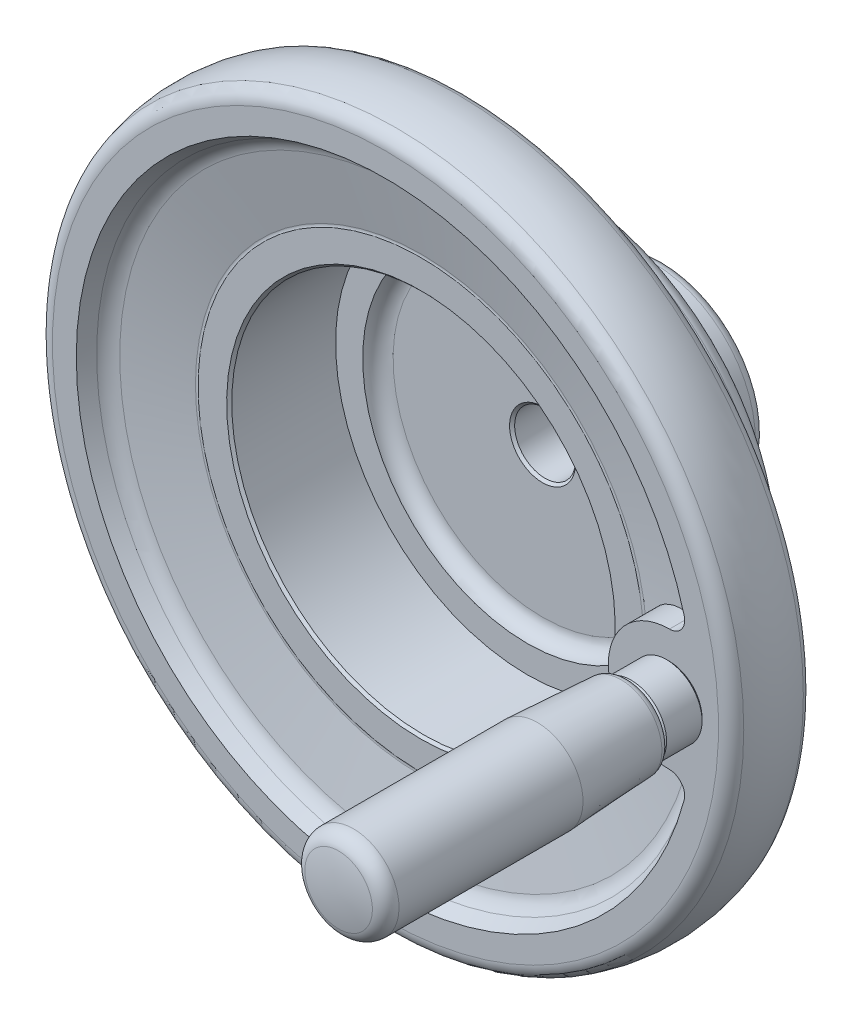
ISO-10303-21;
HEADER;
FILE_DESCRIPTION(('STEP AP214'),'2;1');
FILE_NAME('part.step','',(''),(''),'','','');
FILE_SCHEMA(('AUTOMOTIVE_DESIGN { 1 0 10303 214 1 1 1 1 }'));
ENDSEC;
DATA;
#1=APPLICATION_CONTEXT('core data for automotive mechanical design processes');
#2=APPLICATION_PROTOCOL_DEFINITION('international standard','automotive_design',2000,#1);
#3=PRODUCT_CONTEXT('',#1,'mechanical');
#4=PRODUCT('Part','Part','',(#3));
#5=PRODUCT_RELATED_PRODUCT_CATEGORY('part','',(#4));
#6=PRODUCT_DEFINITION_FORMATION('','',#4);
#7=PRODUCT_DEFINITION_CONTEXT('part definition',#1,'design');
#8=PRODUCT_DEFINITION('design','',#6,#7);
#9=PRODUCT_DEFINITION_SHAPE('','',#8);
#10=(LENGTH_UNIT() NAMED_UNIT(*) SI_UNIT(.MILLI.,.METRE.));
#11=(NAMED_UNIT(*) PLANE_ANGLE_UNIT() SI_UNIT($,.RADIAN.));
#12=(NAMED_UNIT(*) SI_UNIT($,.STERADIAN.) SOLID_ANGLE_UNIT());
#13=UNCERTAINTY_MEASURE_WITH_UNIT(LENGTH_MEASURE(1.E-05),#10,'distance_accuracy_value','');
#14=(GEOMETRIC_REPRESENTATION_CONTEXT(3) GLOBAL_UNCERTAINTY_ASSIGNED_CONTEXT((#13)) GLOBAL_UNIT_ASSIGNED_CONTEXT((#10,
#11,#12)) REPRESENTATION_CONTEXT('',''));
#15=CARTESIAN_POINT('',(0.,0.,0.));
#16=DIRECTION('',(0.,0.,1.));
#17=DIRECTION('',(1.,0.,0.));
#18=AXIS2_PLACEMENT_3D('',#15,#16,#17);
#19=CARTESIAN_POINT('',(0.,0.,-10.));
#20=DIRECTION('',(0.,0.,-1.));
#21=DIRECTION('',(0.,1.,0.));
#22=AXIS2_PLACEMENT_3D('',#19,#20,#21);
#23=CYLINDRICAL_SURFACE('',#22,6.);
#24=CARTESIAN_POINT('',(0.,0.,23.5));
#25=DIRECTION('',(0.,0.,1.));
#26=DIRECTION('',(0.,-1.,0.));
#27=AXIS2_PLACEMENT_3D('',#24,#25,#26);
#28=CIRCLE('',#27,6.);
#29=CARTESIAN_POINT('',(0.,-6.,23.5));
#30=VERTEX_POINT('',#29);
#31=EDGE_CURVE('E22',#30,#30,#28,.T.);
#32=ORIENTED_EDGE('',*,*,#31,.T.);
#33=EDGE_LOOP('',(#32));
#34=FACE_BOUND('',#33,.T.);
#35=CARTESIAN_POINT('',(0.,6.,10.5));
#36=CARTESIAN_POINT('',(0.133903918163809,5.99999628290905,10.4999952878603));
#37=CARTESIAN_POINT('',(0.26803952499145,5.99546656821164,10.4891786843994));
#38=CARTESIAN_POINT('',(0.532498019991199,5.97780115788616,10.4463192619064));
#39=CARTESIAN_POINT('',(0.662810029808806,5.96464300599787,10.4142210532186));
#40=CARTESIAN_POINT('',(0.915376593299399,5.93112629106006,10.3301785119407));
#41=CARTESIAN_POINT('',(1.037656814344,5.91079213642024,10.2783014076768));
#42=CARTESIAN_POINT('',(1.27165974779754,5.86490559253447,10.156454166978));
#43=CARTESIAN_POINT('',(1.38338564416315,5.83935478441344,10.0864895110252));
#44=CARTESIAN_POINT('',(1.59889674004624,5.7841566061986,9.92674208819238));
#45=CARTESIAN_POINT('',(1.7020825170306,5.75437507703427,9.83619739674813));
#46=CARTESIAN_POINT('',(1.8923196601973,5.69465427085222,9.63947131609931));
#47=CARTESIAN_POINT('',(1.97936253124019,5.66471491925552,9.53328174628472));
#48=CARTESIAN_POINT('',(2.13907474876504,5.60642043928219,9.30194644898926));
#49=CARTESIAN_POINT('',(2.21082616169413,5.57821573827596,9.17612510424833));
#50=CARTESIAN_POINT('',(2.33187881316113,5.52871144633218,8.91285348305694));
#51=CARTESIAN_POINT('',(2.3811916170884,5.50740829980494,8.77540924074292));
#52=CARTESIAN_POINT('',(2.45349196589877,5.47557110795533,8.49969261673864));
#53=CARTESIAN_POINT('',(2.47763315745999,5.46456775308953,8.36177903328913));
#54=CARTESIAN_POINT('',(2.50250419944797,5.45322652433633,8.08345341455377));
#55=CARTESIAN_POINT('',(2.50324696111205,5.45288276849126,7.94304279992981));
#56=CARTESIAN_POINT('',(2.48216900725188,5.46250239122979,7.6751998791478));
#57=CARTESIAN_POINT('',(2.46207362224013,5.47167765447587,7.54759780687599));
#58=CARTESIAN_POINT('',(2.40278382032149,5.49796965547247,7.2977758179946));
#59=CARTESIAN_POINT('',(2.36358574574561,5.51508791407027,7.17555693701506));
#60=CARTESIAN_POINT('',(2.26643917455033,5.555723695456,6.93688459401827));
#61=CARTESIAN_POINT('',(2.20810943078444,5.57936963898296,6.82060915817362));
#62=CARTESIAN_POINT('',(2.07462485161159,5.63036662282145,6.59904453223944));
#63=CARTESIAN_POINT('',(1.99946338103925,5.65771912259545,6.49375969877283));
#64=CARTESIAN_POINT('',(1.82699193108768,5.71585953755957,6.28780008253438));
#65=CARTESIAN_POINT('',(1.72834696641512,5.74674242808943,6.18826686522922));
#66=CARTESIAN_POINT('',(1.51545918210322,5.80651346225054,6.00677299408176));
#67=CARTESIAN_POINT('',(1.40121271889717,5.83540113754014,5.92481645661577));
#68=CARTESIAN_POINT('',(1.15689589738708,5.8887656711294,5.77912835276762));
#69=CARTESIAN_POINT('',(1.02652116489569,5.91312533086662,5.71586110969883));
#70=CARTESIAN_POINT('',(0.755704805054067,5.95378962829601,5.61255772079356));
#71=CARTESIAN_POINT('',(0.615268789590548,5.97009871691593,5.57250873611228));
#72=CARTESIAN_POINT('',(0.337856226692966,5.99199282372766,5.51916801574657));
#73=CARTESIAN_POINT('',(0.201222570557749,5.9981908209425,5.50434428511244));
#74=CARTESIAN_POINT('',(-0.0727093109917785,6.00112100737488,5.49730755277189));
#75=CARTESIAN_POINT('',(-0.210007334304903,5.99785591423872,5.50508805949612));
#76=CARTESIAN_POINT('',(-0.474196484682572,5.98262435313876,5.54194216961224));
#77=CARTESIAN_POINT('',(-0.601265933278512,5.97109774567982,5.56993990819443));
#78=CARTESIAN_POINT('',(-0.848765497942,5.94097213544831,5.6449363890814));
#79=CARTESIAN_POINT('',(-0.969194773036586,5.92237223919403,5.69193753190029));
#80=CARTESIAN_POINT('',(-1.20421799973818,5.87916541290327,5.80514195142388));
#81=CARTESIAN_POINT('',(-1.31851447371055,5.85438982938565,5.87189636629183));
#82=CARTESIAN_POINT('',(-1.53469243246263,5.80147609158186,6.02210675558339));
#83=CARTESIAN_POINT('',(-1.63656870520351,5.77333653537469,6.10556970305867));
#84=CARTESIAN_POINT('',(-1.83266686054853,5.71424175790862,6.2938064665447));
#85=CARTESIAN_POINT('',(-1.92582139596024,5.6832290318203,6.39967700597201));
#86=CARTESIAN_POINT('',(-2.09333969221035,5.62368673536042,6.62604255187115));
#87=CARTESIAN_POINT('',(-2.16769918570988,5.59515772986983,6.7465408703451));
#88=CARTESIAN_POINT('',(-2.29631920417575,5.54362772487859,7.00122835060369));
#89=CARTESIAN_POINT('',(-2.35027836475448,5.52071125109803,7.13558807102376));
#90=CARTESIAN_POINT('',(-2.43434827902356,5.48416711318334,7.4127411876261));
#91=CARTESIAN_POINT('',(-2.46447869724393,5.47053179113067,7.55552752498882));
#92=CARTESIAN_POINT('',(-2.49808160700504,5.45526329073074,7.8336373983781));
#93=CARTESIAN_POINT('',(-2.50342760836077,5.45278701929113,7.96868932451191));
#94=CARTESIAN_POINT('',(-2.49231151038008,5.45787706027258,8.23768572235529));
#95=CARTESIAN_POINT('',(-2.47585275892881,5.46544183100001,8.37163036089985));
#96=CARTESIAN_POINT('',(-2.42316809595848,5.48899102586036,8.62818549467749));
#97=CARTESIAN_POINT('',(-2.38789807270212,5.50456709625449,8.7510333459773));
#98=CARTESIAN_POINT('',(-2.2995265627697,5.54206362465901,8.98909604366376));
#99=CARTESIAN_POINT('',(-2.24642006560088,5.56398586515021,9.10430873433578));
#100=CARTESIAN_POINT('',(-2.12020572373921,5.61333908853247,9.33139178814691));
#101=CARTESIAN_POINT('',(-2.04608723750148,5.64102204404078,9.44264464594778));
#102=CARTESIAN_POINT('',(-1.88136812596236,5.69807379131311,9.65172029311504));
#103=CARTESIAN_POINT('',(-1.79076178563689,5.72744316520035,9.74953840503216));
#104=CARTESIAN_POINT('',(-1.58780416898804,5.78712781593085,9.93629730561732));
#105=CARTESIAN_POINT('',(-1.47434977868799,5.81735619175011,10.0240726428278));
#106=CARTESIAN_POINT('',(-1.2331998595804,5.87320303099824,10.1793991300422));
#107=CARTESIAN_POINT('',(-1.10549787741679,5.89881939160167,10.2469410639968));
#108=CARTESIAN_POINT('',(-0.841465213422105,5.94218308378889,10.3584188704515));
#109=CARTESIAN_POINT('',(-0.705312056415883,5.9600534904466,10.4027264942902));
#110=CARTESIAN_POINT('',(-0.426816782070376,5.98642234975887,10.4674156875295));
#111=CARTESIAN_POINT('',(-0.284495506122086,5.99495014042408,10.4878721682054));
#112=CARTESIAN_POINT('',(-0.11805251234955,5.99888566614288,10.4973238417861));
#113=CARTESIAN_POINT('',(-0.0944569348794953,5.99930292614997,10.498326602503));
#114=CARTESIAN_POINT('',(-0.0472433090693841,5.99986042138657,10.4996650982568));
#115=CARTESIAN_POINT('',(-0.0236252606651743,6.0000006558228,10.5000008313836));
#116=CARTESIAN_POINT('',(0.,6.,10.5));
#117=B_SPLINE_CURVE_WITH_KNOTS('',3,(#35,#36,#37,#38,#39,#40,#41,#42,#43,#44,#45,#46,#47,#48,
#49,#50,#51,#52,#53,#54,#55,#56,#57,#58,#59,#60,#61,#62,#63,#64,#65,#66,#67,#68,#69,#70,#71,#72,
#73,#74,#75,#76,#77,#78,#79,#80,#81,#82,#83,#84,#85,#86,#87,#88,#89,#90,#91,#92,#93,#94,#95,#96,
#97,#98,#99,#100,#101,#102,#103,#104,#105,#106,#107,#108,#109,#110,#111,#112,#113,#114,#115,
#116),.UNSPECIFIED.,.T.,.F.,(4,2,2,2,2,2,2,2,2,2,2,2,2,2,2,2,2,2,2,2,2,2,2,2,2,2,2,2,2,2,2,2,2,
2,2,2,2,2,2,2,4),(0.,0.401613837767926,0.804277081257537,1.20558370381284,1.60676887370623,
2.02635872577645,2.44616876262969,2.88663449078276,3.32687293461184,3.74590546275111,
4.1647067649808,4.55140314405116,4.9381735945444,5.33317426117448,5.72833091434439,
6.15688282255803,6.58553498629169,7.02408110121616,7.46238448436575,7.87296886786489,
8.28343534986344,8.67353179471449,9.06367753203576,9.46594270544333,9.86837610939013,
10.2995697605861,10.730861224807,11.1682957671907,11.6053689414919,12.008797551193,
12.4121642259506,12.7967529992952,13.1814498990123,13.5892778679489,13.9972474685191,
14.434930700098,14.8728129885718,15.3034571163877,15.7327450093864,15.8036033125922,
15.874461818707),.UNSPECIFIED.);
#118=CARTESIAN_POINT('',(0.,6.,10.5));
#119=VERTEX_POINT('',#118);
#120=EDGE_CURVE('E119',#119,#119,#117,.T.);
#121=ORIENTED_EDGE('',*,*,#120,.T.);
#122=EDGE_LOOP('',(#121));
#123=FACE_BOUND('',#122,.T.);
#124=CARTESIAN_POINT('',(-5.45435605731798,-2.49999999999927,8.));
#125=CARTESIAN_POINT('',(-5.45435734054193,-2.49999850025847,8.06670818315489));
#126=CARTESIAN_POINT('',(-5.45558543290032,-2.49732449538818,8.13343479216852));
#127=CARTESIAN_POINT('',(-5.46045125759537,-2.48666416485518,8.26638647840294));
#128=CARTESIAN_POINT('',(-5.4640904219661,-2.4786746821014,8.33261123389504));
#129=CARTESIAN_POINT('',(-5.47848490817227,-2.44679265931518,8.53005186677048));
#130=CARTESIAN_POINT('',(-5.49271671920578,-2.41498683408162,8.65983681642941));
#131=CARTESIAN_POINT('',(-5.52853615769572,-2.33180001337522,8.9111547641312));
#132=CARTESIAN_POINT('',(-5.55009376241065,-2.28049881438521,9.03271905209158));
#133=CARTESIAN_POINT('',(-5.59808356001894,-2.1600126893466,9.2655101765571));
#134=CARTESIAN_POINT('',(-5.62451459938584,-2.09083199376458,9.37673944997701));
#135=CARTESIAN_POINT('',(-5.68111508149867,-1.93194778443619,9.59265398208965));
#136=CARTESIAN_POINT('',(-5.71141131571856,-1.84130648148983,9.69661579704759));
#137=CARTESIAN_POINT('',(-5.77128595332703,-1.6440433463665,9.88839976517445));
#138=CARTESIAN_POINT('',(-5.80086407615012,-1.53741538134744,9.97621569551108));
#139=CARTESIAN_POINT('',(-5.85751074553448,-1.30552678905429,10.1368992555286));
#140=CARTESIAN_POINT('',(-5.88441479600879,-1.17965858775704,10.2089533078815));
#141=CARTESIAN_POINT('',(-5.93113040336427,-0.916264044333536,10.3305519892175));
#142=CARTESIAN_POINT('',(-5.95094510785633,-0.778742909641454,10.3801066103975));
#143=CARTESIAN_POINT('',(-5.98035041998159,-0.503536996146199,10.4526789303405));
#144=CARTESIAN_POINT('',(-5.990419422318,-0.366233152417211,10.4769433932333));
#145=CARTESIAN_POINT('',(-6.00093657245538,-0.0891583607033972,10.5022752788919));
#146=CARTESIAN_POINT('',(-6.00138862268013,0.0506115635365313,10.503352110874));
#147=CARTESIAN_POINT('',(-5.99290258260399,0.319585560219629,10.4829314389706));
#148=CARTESIAN_POINT('',(-5.98453429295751,0.448914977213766,10.4628037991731));
#149=CARTESIAN_POINT('',(-5.96013033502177,0.702165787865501,10.4028937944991));
#150=CARTESIAN_POINT('',(-5.94409410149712,0.826086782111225,10.3631099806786));
#151=CARTESIAN_POINT('',(-5.90559704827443,1.06727623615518,10.2645439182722));
#152=CARTESIAN_POINT('',(-5.88304194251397,1.18441435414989,10.2054810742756));
#153=CARTESIAN_POINT('',(-5.83371427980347,1.40742353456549,10.0703084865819));
#154=CARTESIAN_POINT('',(-5.80694023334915,1.51329059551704,9.99419271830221));
#155=CARTESIAN_POINT('',(-5.74963397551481,1.71868182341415,9.82083515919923));
#156=CARTESIAN_POINT('',(-5.71896988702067,1.81723287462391,9.72248241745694));
#157=CARTESIAN_POINT('',(-5.65875721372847,1.99686282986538,9.51057711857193));
#158=CARTESIAN_POINT('',(-5.62920906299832,2.07793499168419,9.39701872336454));
#159=CARTESIAN_POINT('',(-5.57363224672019,2.22280378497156,9.15320992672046));
#160=CARTESIAN_POINT('',(-5.54775116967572,2.28594506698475,9.02253358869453));
#161=CARTESIAN_POINT('',(-5.50419688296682,2.38892864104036,8.75103791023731));
#162=CARTESIAN_POINT('',(-5.48651780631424,2.42878759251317,8.61022590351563));
#163=CARTESIAN_POINT('',(-5.4628242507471,2.48160050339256,8.3322063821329));
#164=CARTESIAN_POINT('',(-5.45612738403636,2.49613229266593,8.19535775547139));
#165=CARTESIAN_POINT('',(-5.45320573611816,2.50251261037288,7.92104303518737));
#166=CARTESIAN_POINT('',(-5.4569773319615,2.49436898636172,7.78357717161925));
#167=CARTESIAN_POINT('',(-5.47386262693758,2.45706955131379,7.52120322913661));
#168=CARTESIAN_POINT('',(-5.48636276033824,2.42929237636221,7.3960546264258));
#169=CARTESIAN_POINT('',(-5.5185126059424,2.35534117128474,7.15229740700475));
#170=CARTESIAN_POINT('',(-5.53816398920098,2.30916284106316,7.03369032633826));
#171=CARTESIAN_POINT('',(-5.58341595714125,2.19755041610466,6.80076937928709));
#172=CARTESIAN_POINT('',(-5.60923324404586,2.1313836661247,6.68685005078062));
#173=CARTESIAN_POINT('',(-5.6636000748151,1.98240156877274,6.47118389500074));
#174=CARTESIAN_POINT('',(-5.69215079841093,1.89957901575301,6.36944236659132));
#175=CARTESIAN_POINT('',(-5.75157239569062,1.71168891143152,6.17239973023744));
#176=CARTESIAN_POINT('',(-5.78244293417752,1.60535932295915,6.07829720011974));
#177=CARTESIAN_POINT('',(-5.84086722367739,1.37770302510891,5.90905541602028));
#178=CARTESIAN_POINT('',(-5.86842073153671,1.25637521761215,5.83391755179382));
#179=CARTESIAN_POINT('',(-5.91728503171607,1.00130936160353,5.70482024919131));
#180=CARTESIAN_POINT('',(-5.93857966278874,0.867540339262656,5.65091551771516));
#181=CARTESIAN_POINT('',(-5.97236346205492,0.591717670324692,5.5667664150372));
#182=CARTESIAN_POINT('',(-5.98485787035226,0.449669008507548,5.53650796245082));
#183=CARTESIAN_POINT('',(-5.99903069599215,0.172033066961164,5.50228374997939));
#184=CARTESIAN_POINT('',(-6.00140409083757,0.0366881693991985,5.49662800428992));
#185=CARTESIAN_POINT('',(-5.99699046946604,-0.232973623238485,5.50722627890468));
#186=CARTESIAN_POINT('',(-5.99020505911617,-0.367290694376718,5.52347645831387));
#187=CARTESIAN_POINT('',(-5.96860132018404,-0.626172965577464,5.57621215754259));
#188=CARTESIAN_POINT('',(-5.95407648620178,-0.750915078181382,5.61195940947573));
#189=CARTESIAN_POINT('',(-5.91858999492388,-0.992584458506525,5.70186844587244));
#190=CARTESIAN_POINT('',(-5.89762711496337,-1.10951023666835,5.7560337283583));
#191=CARTESIAN_POINT('',(-5.85011651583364,-1.33804914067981,5.88397924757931));
#192=CARTESIAN_POINT('',(-5.82335921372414,-1.44918335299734,5.95853532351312));
#193=CARTESIAN_POINT('',(-5.767431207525,-1.65783731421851,6.12401364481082));
#194=CARTESIAN_POINT('',(-5.73825960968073,-1.75535198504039,6.21494196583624));
#195=CARTESIAN_POINT('',(-5.67829702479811,-1.9408997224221,6.4178925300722));
#196=CARTESIAN_POINT('',(-5.64753091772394,-2.02783607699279,6.53092911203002));
#197=CARTESIAN_POINT('',(-5.5899105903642,-2.18166607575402,6.77090639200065));
#198=CARTESIAN_POINT('',(-5.56305856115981,-2.24854851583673,6.89785480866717));
#199=CARTESIAN_POINT('',(-5.51685287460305,-2.35965744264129,7.16192893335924));
#200=CARTESIAN_POINT('',(-5.49745949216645,-2.40400437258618,7.29899595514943));
#201=CARTESIAN_POINT('',(-5.47594959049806,-2.452399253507,7.50916376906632));
#202=CARTESIAN_POINT('',(-5.47004503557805,-2.46550603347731,7.579910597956));
#203=CARTESIAN_POINT('',(-5.46095373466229,-2.48558130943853,7.72242605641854));
#204=CARTESIAN_POINT('',(-5.45776506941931,-2.49255414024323,7.79419392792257));
#205=CARTESIAN_POINT('',(-5.45490391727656,-2.4988047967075,7.910711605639));
#206=CARTESIAN_POINT('',(-5.45435519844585,-2.50000100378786,7.95535167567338));
#207=CARTESIAN_POINT('',(-5.45435605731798,-2.49999999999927,8.));
#208=B_SPLINE_CURVE_WITH_KNOTS('',3,(#124,#125,#126,#127,#128,#129,#130,#131,#132,#133,#134,
#135,#136,#137,#138,#139,#140,#141,#142,#143,#144,#145,#146,#147,#148,#149,#150,#151,#152,#153,
#154,#155,#156,#157,#158,#159,#160,#161,#162,#163,#164,#165,#166,#167,#168,#169,#170,#171,#172,
#173,#174,#175,#176,#177,#178,#179,#180,#181,#182,#183,#184,#185,#186,#187,#188,#189,#190,#191,
#192,#193,#194,#195,#196,#197,#198,#199,#200,#201,#202,#203,#204,#205,#206,#207),.UNSPECIFIED.,
.T.,.F.,(4,2,2,2,2,2,2,2,2,2,2,2,2,2,2,2,2,2,2,2,2,2,2,2,2,2,2,2,2,2,2,2,2,2,2,2,2,2,2,2,2,4),
(0.,0.20008457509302,0.400288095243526,0.801278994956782,1.20064597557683,1.59991854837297,
2.02172149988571,2.44368668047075,2.88395420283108,3.32402600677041,3.74119679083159,
4.15819828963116,4.54982147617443,4.94147353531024,5.33910096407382,5.73686909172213,
6.16267530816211,6.58864548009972,7.0286155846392,7.46827048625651,7.87940023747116,
8.29038772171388,8.67506269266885,9.05982760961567,9.46088720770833,9.86212068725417,
10.2960179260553,10.7299469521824,11.1649867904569,11.5997673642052,12.0041573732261,
12.4084764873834,12.7984529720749,13.1885035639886,13.5961819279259,14.0040118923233,
14.4395932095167,14.8754174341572,15.3088871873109,15.5252058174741,15.7413714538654,
15.8752896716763),.UNSPECIFIED.);
#209=CARTESIAN_POINT('',(-5.45435605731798,-2.49999999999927,8.));
#210=VERTEX_POINT('',#209);
#211=EDGE_CURVE('E151',#210,#210,#208,.T.);
#212=ORIENTED_EDGE('',*,*,#211,.T.);
#213=EDGE_LOOP('',(#212));
#214=FACE_BOUND('',#213,.T.);
#215=CARTESIAN_POINT('',(0.,0.,0.500000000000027));
#216=DIRECTION('',(0.,0.,-1.));
#217=DIRECTION('',(0.,1.,0.));
#218=AXIS2_PLACEMENT_3D('',#215,#216,#217);
#219=CIRCLE('',#218,6.);
#220=CARTESIAN_POINT('',(0.,6.,0.500000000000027));
#221=VERTEX_POINT('',#220);
#222=EDGE_CURVE('E211',#221,#221,#219,.T.);
#223=ORIENTED_EDGE('',*,*,#222,.T.);
#224=EDGE_LOOP('',(#223));
#225=FACE_BOUND('',#224,.T.);
#226=ADVANCED_FACE('F14',(#34,#123,#214,#225),#23,.F.);
#227=CARTESIAN_POINT('',(0.,0.,127.247856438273));
#228=DIRECTION('',(0.,0.,1.));
#229=DIRECTION('',(0.,-1.,0.));
#230=AXIS2_PLACEMENT_3D('',#227,#228,#229);
#231=CYLINDRICAL_SURFACE('',#230,37.85);
#232=CARTESIAN_POINT('',(0.,0.,27.));
#233=DIRECTION('',(0.,0.,1.));
#234=DIRECTION('',(0.,-1.,0.));
#235=AXIS2_PLACEMENT_3D('',#232,#233,#234);
#236=CIRCLE('',#235,37.85);
#237=CARTESIAN_POINT('',(0.,-37.85,27.));
#238=VERTEX_POINT('',#237);
#239=EDGE_CURVE('E196',#238,#238,#236,.T.);
#240=ORIENTED_EDGE('',*,*,#239,.F.);
#241=EDGE_LOOP('',(#240));
#242=FACE_BOUND('',#241,.T.);
#243=CARTESIAN_POINT('',(0.,0.,47.5));
#244=DIRECTION('',(0.,0.,1.));
#245=DIRECTION('',(0.,-1.,0.));
#246=AXIS2_PLACEMENT_3D('',#243,#244,#245);
#247=CIRCLE('',#246,37.85);
#248=CARTESIAN_POINT('',(0.,-37.85,47.5));
#249=VERTEX_POINT('',#248);
#250=EDGE_CURVE('E205',#249,#249,#247,.T.);
#251=ORIENTED_EDGE('',*,*,#250,.T.);
#252=EDGE_LOOP('',(#251));
#253=FACE_BOUND('',#252,.T.);
#254=CARTESIAN_POINT('',(0.,37.85,31.5));
#255=CARTESIAN_POINT('',(-0.14026204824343,37.8499989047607,31.5000061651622));
#256=CARTESIAN_POINT('',(-0.280621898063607,37.8492120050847,31.5118437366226));
#257=CARTESIAN_POINT('',(-0.55746476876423,37.8461485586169,31.55889558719));
#258=CARTESIAN_POINT('',(-0.693943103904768,37.8438702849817,31.5941369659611));
#259=CARTESIAN_POINT('',(-0.958972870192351,37.8380817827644,31.6869787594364));
#260=CARTESIAN_POINT('',(-1.08752848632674,37.8345722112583,31.7445672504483));
#261=CARTESIAN_POINT('',(-1.33311529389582,37.8267156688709,31.8804488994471));
#262=CARTESIAN_POINT('',(-1.45014909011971,37.8223688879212,31.9587373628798));
#263=CARTESIAN_POINT('',(-1.66959707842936,37.8133183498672,32.1339382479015));
#264=CARTESIAN_POINT('',(-1.77198964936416,37.8086140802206,32.2308777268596));
#265=CARTESIAN_POINT('',(-1.95906361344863,37.7993831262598,32.4405728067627));
#266=CARTESIAN_POINT('',(-2.04374426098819,37.7948564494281,32.5533290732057));
#267=CARTESIAN_POINT('',(-2.19305863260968,37.7864871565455,32.7915812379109));
#268=CARTESIAN_POINT('',(-2.25767417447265,37.7826451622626,32.9170885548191));
#269=CARTESIAN_POINT('',(-2.36490784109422,37.7760852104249,33.1772001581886));
#270=CARTESIAN_POINT('',(-2.40752622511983,37.773367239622,33.3118043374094));
#271=CARTESIAN_POINT('',(-2.46949520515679,37.7693667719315,33.5860786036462));
#272=CARTESIAN_POINT('',(-2.48887997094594,37.7680821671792,33.7257409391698));
#273=CARTESIAN_POINT('',(-2.5039369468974,37.7670869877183,34.0063426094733));
#274=CARTESIAN_POINT('',(-2.49960945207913,37.7673763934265,34.1472819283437));
#275=CARTESIAN_POINT('',(-2.46739308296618,37.7694946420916,34.4262037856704));
#276=CARTESIAN_POINT('',(-2.43954120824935,37.7713210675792,34.5641906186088));
#277=CARTESIAN_POINT('',(-2.36112409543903,37.7763037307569,34.8335263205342));
#278=CARTESIAN_POINT('',(-2.31055870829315,37.7794599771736,34.9648751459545));
#279=CARTESIAN_POINT('',(-2.1881080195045,37.7867493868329,35.2173250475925));
#280=CARTESIAN_POINT('',(-2.11620596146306,37.7908833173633,35.3384179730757));
#281=CARTESIAN_POINT('',(-1.95313509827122,37.7996614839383,35.566829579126));
#282=CARTESIAN_POINT('',(-1.86196605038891,37.8043057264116,35.6741480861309));
#283=CARTESIAN_POINT('',(-1.66274090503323,37.813591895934,35.8721797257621));
#284=CARTESIAN_POINT('',(-1.55465279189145,37.8182338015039,35.9628606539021));
#285=CARTESIAN_POINT('',(-1.32476989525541,37.8269836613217,36.1247945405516));
#286=CARTESIAN_POINT('',(-1.20297510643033,37.8310916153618,36.1960474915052));
#287=CARTESIAN_POINT('',(-0.949116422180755,37.8383110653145,36.3171001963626));
#288=CARTESIAN_POINT('',(-0.817051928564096,37.8414225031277,36.3668986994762));
#289=CARTESIAN_POINT('',(-0.546411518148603,37.8462975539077,36.4436072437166));
#290=CARTESIAN_POINT('',(-0.40783568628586,37.8480611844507,36.4705175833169));
#291=CARTESIAN_POINT('',(-0.128385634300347,37.8500396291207,36.500645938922));
#292=CARTESIAN_POINT('',(0.0124837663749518,37.8502573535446,36.5039084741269));
#293=CARTESIAN_POINT('',(0.292767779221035,37.8491271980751,36.4867649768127));
#294=CARTESIAN_POINT('',(0.432182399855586,37.8477793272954,36.4663590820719));
#295=CARTESIAN_POINT('',(0.705473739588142,37.8436715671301,36.402494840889));
#296=CARTESIAN_POINT('',(0.839355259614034,37.8409129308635,36.3590569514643));
#297=CARTESIAN_POINT('',(1.09792825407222,37.8342939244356,36.2503825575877));
#298=CARTESIAN_POINT('',(1.22261963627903,37.8304335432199,36.185145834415));
#299=CARTESIAN_POINT('',(1.45947650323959,37.8220374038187,36.0346124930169));
#300=CARTESIAN_POINT('',(1.57162307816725,37.8175006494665,35.9492861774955));
#301=CARTESIAN_POINT('',(1.78001646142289,37.8082655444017,35.7610389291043));
#302=CARTESIAN_POINT('',(1.87626309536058,37.8035671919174,35.6581178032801));
#303=CARTESIAN_POINT('',(2.05027560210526,37.7945299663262,35.437410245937));
#304=CARTESIAN_POINT('',(2.12801256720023,37.7901916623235,35.3196009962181));
#305=CARTESIAN_POINT('',(2.26260126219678,37.782372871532,35.0725758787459));
#306=CARTESIAN_POINT('',(2.31945313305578,37.7788923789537,34.9433600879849));
#307=CARTESIAN_POINT('',(2.41060788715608,37.7731858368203,34.6772949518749));
#308=CARTESIAN_POINT('',(2.4449288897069,37.7709587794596,34.5404518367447));
#309=CARTESIAN_POINT('',(2.49010680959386,37.7680074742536,34.2629301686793));
#310=CARTESIAN_POINT('',(2.50096399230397,37.7672832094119,34.1222516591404));
#311=CARTESIAN_POINT('',(2.4989034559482,37.7674195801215,33.8413399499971));
#312=CARTESIAN_POINT('',(2.4860311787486,37.7682771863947,33.7011064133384));
#313=CARTESIAN_POINT('',(2.43697141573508,37.7714742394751,33.424796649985));
#314=CARTESIAN_POINT('',(2.40078388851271,37.773813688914,33.2887204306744));
#315=CARTESIAN_POINT('',(2.30613130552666,37.7797100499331,33.0245818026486));
#316=CARTESIAN_POINT('',(2.24766654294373,37.783266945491,32.8965192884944));
#317=CARTESIAN_POINT('',(2.11012507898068,37.7911973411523,32.6520215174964));
#318=CARTESIAN_POINT('',(2.03104887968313,37.7955708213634,32.5355859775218));
#319=CARTESIAN_POINT('',(1.85436046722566,37.8046513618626,32.3174163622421));
#320=CARTESIAN_POINT('',(1.75671521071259,37.8093590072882,32.2157090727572));
#321=CARTESIAN_POINT('',(1.54570851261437,37.8185723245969,32.0300936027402));
#322=CARTESIAN_POINT('',(1.4323432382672,37.8230779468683,31.9461897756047));
#323=CARTESIAN_POINT('',(1.19297226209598,37.8313847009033,31.7984937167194));
#324=CARTESIAN_POINT('',(1.06694995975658,37.835184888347,31.7347283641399));
#325=CARTESIAN_POINT('',(0.806053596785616,37.8416402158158,31.6293404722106));
#326=CARTESIAN_POINT('',(0.671190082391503,37.8442966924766,31.5876920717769));
#327=CARTESIAN_POINT('',(0.446254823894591,37.8474712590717,31.538512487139));
#328=CARTESIAN_POINT('',(0.357636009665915,37.8484153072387,31.5240890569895));
#329=CARTESIAN_POINT('',(0.1793581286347,37.8496800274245,31.5048308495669));
#330=CARTESIAN_POINT('',(0.0896990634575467,37.8500007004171,31.4999960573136));
#331=CARTESIAN_POINT('',(0.,37.85,31.5));
#332=B_SPLINE_CURVE_WITH_KNOTS('',3,(#254,#255,#256,#257,#258,#259,#260,#261,#262,#263,#264,
#265,#266,#267,#268,#269,#270,#271,#272,#273,#274,#275,#276,#277,#278,#279,#280,#281,#282,#283,
#284,#285,#286,#287,#288,#289,#290,#291,#292,#293,#294,#295,#296,#297,#298,#299,#300,#301,#302,
#303,#304,#305,#306,#307,#308,#309,#310,#311,#312,#313,#314,#315,#316,#317,#318,#319,#320,#321,
#322,#323,#324,#325,#326,#327,#328,#329,#330,#331),.UNSPECIFIED.,.T.,.F.,(4,2,2,2,2,2,2,2,2,2,2,
2,2,2,2,2,2,2,2,2,2,2,2,2,2,2,2,2,2,2,2,2,2,2,2,2,2,2,4),(0.,0.420458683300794,0.84140507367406,
1.26212716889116,1.68275393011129,2.10399556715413,2.52525493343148,2.94689492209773,
3.36852994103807,3.78954409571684,4.21055301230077,4.63090098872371,5.05125172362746,
5.47193345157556,5.89262047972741,6.31411341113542,6.73560650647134,7.15712417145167,
7.57863633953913,7.99935476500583,8.42007074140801,8.84041366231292,9.26076080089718,
9.68173325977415,10.1027103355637,10.52434062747,10.9459680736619,11.3672560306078,
11.7885392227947,12.2090164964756,12.6294945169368,13.0499670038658,13.4704292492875,
13.8916468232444,14.3129672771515,14.7348477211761,15.1562337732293,15.425121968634,
15.6940097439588),.UNSPECIFIED.);
#333=CARTESIAN_POINT('',(0.,37.85,31.5));
#334=VERTEX_POINT('',#333);
#335=EDGE_CURVE('E215',#334,#334,#332,.T.);
#336=ORIENTED_EDGE('',*,*,#335,.T.);
#337=EDGE_LOOP('',(#336));
#338=FACE_BOUND('',#337,.T.);
#339=ADVANCED_FACE('F161',(#242,#253,#338),#231,.F.);
#340=CARTESIAN_POINT('',(0.,69.5,34.));
#341=DIRECTION('',(0.,-1.,0.));
#342=DIRECTION('',(0.,0.,-1.));
#343=AXIS2_PLACEMENT_3D('',#340,#341,#342);
#344=CYLINDRICAL_SURFACE('',#343,2.5);
#345=CARTESIAN_POINT('',(-1.78700634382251,43.5974636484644,35.7483158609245));
#346=CARTESIAN_POINT('',(-1.88543578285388,43.5881516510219,35.6476994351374));
#347=CARTESIAN_POINT('',(-1.97540003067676,43.5784109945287,35.5386994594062));
#348=CARTESIAN_POINT('',(-2.1357751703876,43.5586911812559,35.3070409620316));
#349=CARTESIAN_POINT('',(-2.20616235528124,43.5487117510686,35.1843661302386));
#350=CARTESIAN_POINT('',(-2.32527537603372,43.529109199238,34.9289422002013));
#351=CARTESIAN_POINT('',(-2.37401092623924,43.5194859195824,34.7961976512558));
#352=CARTESIAN_POINT('',(-2.44844391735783,43.5010942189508,34.5243814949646));
#353=CARTESIAN_POINT('',(-2.47414734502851,43.4923255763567,34.3853115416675));
#354=CARTESIAN_POINT('',(-2.50176749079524,43.4760236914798,34.1048634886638));
#355=CARTESIAN_POINT('',(-2.50370241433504,43.4684895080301,33.9634872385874));
#356=CARTESIAN_POINT('',(-2.48373875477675,43.4548769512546,33.6823509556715));
#357=CARTESIAN_POINT('',(-2.46183959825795,43.4487986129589,33.5425909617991));
#358=CARTESIAN_POINT('',(-2.39490364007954,43.4381851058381,33.2691139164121));
#359=CARTESIAN_POINT('',(-2.34993690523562,43.4336453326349,33.1353798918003));
#360=CARTESIAN_POINT('',(-2.23816455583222,43.4260062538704,32.8773292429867));
#361=CARTESIAN_POINT('',(-2.17135918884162,43.4229069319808,32.7530125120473));
#362=CARTESIAN_POINT('',(-2.01792759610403,43.417953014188,32.5175413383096));
#363=CARTESIAN_POINT('',(-1.93133361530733,43.4160964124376,32.4063659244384));
#364=CARTESIAN_POINT('',(-1.74071959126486,43.4133377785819,32.200107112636));
#365=CARTESIAN_POINT('',(-1.63669955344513,43.4124357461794,32.1050237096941));
#366=CARTESIAN_POINT('',(-1.41415277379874,43.4112670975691,31.9336255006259));
#367=CARTESIAN_POINT('',(-1.29562204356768,43.4110006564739,31.8573158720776));
#368=CARTESIAN_POINT('',(-1.04743789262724,43.4107958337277,31.7256636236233));
#369=CARTESIAN_POINT('',(-0.917784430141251,43.410857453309,31.6703210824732));
#370=CARTESIAN_POINT('',(-0.650951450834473,43.411056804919,31.5821461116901));
#371=CARTESIAN_POINT('',(-0.513767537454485,43.4111945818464,31.5493269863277));
#372=CARTESIAN_POINT('',(-0.23583714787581,43.4113852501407,31.5071830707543));
#373=CARTESIAN_POINT('',(-0.0950906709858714,43.4114381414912,31.4978582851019));
#374=CARTESIAN_POINT('',(0.185985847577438,43.4114117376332,31.5029679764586));
#375=CARTESIAN_POINT('',(0.326315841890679,43.411332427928,31.5174050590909));
#376=CARTESIAN_POINT('',(0.602560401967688,43.4111145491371,31.5696336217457));
#377=CARTESIAN_POINT('',(0.738474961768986,43.4109759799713,31.6074251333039));
#378=CARTESIAN_POINT('',(1.00203101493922,43.4108227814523,31.7052900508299));
#379=CARTESIAN_POINT('',(1.129672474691,43.4108081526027,31.7653635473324));
#380=CARTESIAN_POINT('',(1.37305796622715,43.4111708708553,31.9060870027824));
#381=CARTESIAN_POINT('',(1.48880200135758,43.4115482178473,31.986736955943));
#382=CARTESIAN_POINT('',(1.70509159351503,43.4130098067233,32.1663105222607));
#383=CARTESIAN_POINT('',(1.80563902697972,43.4140939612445,32.2652318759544));
#384=CARTESIAN_POINT('',(1.98869541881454,43.4172849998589,32.4785393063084));
#385=CARTESIAN_POINT('',(2.07120448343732,43.4193918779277,32.5929252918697));
#386=CARTESIAN_POINT('',(2.21579827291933,43.4248949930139,32.8338262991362));
#387=CARTESIAN_POINT('',(2.27789548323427,43.4282904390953,32.9603338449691));
#388=CARTESIAN_POINT('',(2.3799829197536,43.4365459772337,33.2219288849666));
#389=CARTESIAN_POINT('',(2.4199732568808,43.4414060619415,33.3570163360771));
#390=CARTESIAN_POINT('',(2.47672871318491,43.452636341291,33.6318902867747));
#391=CARTESIAN_POINT('',(2.49349923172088,43.4590061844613,33.7716756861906));
#392=CARTESIAN_POINT('',(2.50339109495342,43.473153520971,34.0520090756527));
#393=CARTESIAN_POINT('',(2.4965122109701,43.4809310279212,34.1925570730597));
#394=CARTESIAN_POINT('',(2.45930332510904,43.4976507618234,34.4706867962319));
#395=CARTESIAN_POINT('',(2.42893331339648,43.5065949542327,34.6082630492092));
#396=CARTESIAN_POINT('',(2.345579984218,43.525237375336,34.8763321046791));
#397=CARTESIAN_POINT('',(2.29259620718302,43.5349356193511,35.0068247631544));
#398=CARTESIAN_POINT('',(2.16532599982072,43.5546019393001,35.2574476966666));
#399=CARTESIAN_POINT('',(2.09097602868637,43.5645707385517,35.3775456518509));
#400=CARTESIAN_POINT('',(1.92312902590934,43.5841585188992,35.6035549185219));
#401=CARTESIAN_POINT('',(1.82963175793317,43.5937774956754,35.7094660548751));
#402=CARTESIAN_POINT('',(1.6260180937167,43.6120585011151,35.9041864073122));
#403=CARTESIAN_POINT('',(1.51588699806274,43.6207196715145,35.9929803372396));
#404=CARTESIAN_POINT('',(1.28216760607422,43.6364888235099,36.1507969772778));
#405=CARTESIAN_POINT('',(1.15857954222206,43.6435968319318,36.2198200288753));
#406=CARTESIAN_POINT('',(0.901897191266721,43.6557377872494,36.335883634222));
#407=CARTESIAN_POINT('',(0.768837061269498,43.6607777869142,36.3829989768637));
#408=CARTESIAN_POINT('',(0.496632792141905,43.668454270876,36.4542095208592));
#409=CARTESIAN_POINT('',(0.357489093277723,43.6710909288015,36.4783063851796));
#410=CARTESIAN_POINT('',(0.0778464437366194,43.673761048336,36.502705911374));
#411=CARTESIAN_POINT('',(-0.0626415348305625,43.6738081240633,36.5031330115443));
#412=CARTESIAN_POINT('',(-0.341723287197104,43.6713294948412,36.4804890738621));
#413=CARTESIAN_POINT('',(-0.480316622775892,43.6688032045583,36.4574126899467));
#414=CARTESIAN_POINT('',(-0.751460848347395,43.6613660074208,36.388484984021));
#415=CARTESIAN_POINT('',(-0.884018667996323,43.6564579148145,36.3426605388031));
#416=CARTESIAN_POINT('',(-1.13944121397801,43.6446107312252,36.2296047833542));
#417=CARTESIAN_POINT('',(-1.26231685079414,43.6376739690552,36.1623980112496));
#418=CARTESIAN_POINT('',(-1.45244949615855,43.6250775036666,36.0367228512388));
#419=CARTESIAN_POINT('',(-1.52362642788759,43.6198770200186,35.9840313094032));
#420=CARTESIAN_POINT('',(-1.65998482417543,43.6089953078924,35.8714348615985));
#421=CARTESIAN_POINT('',(-1.7251662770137,43.6033140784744,35.8115299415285));
#422=CARTESIAN_POINT('',(-1.78700634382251,43.5974636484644,35.7483158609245));
#423=B_SPLINE_CURVE_WITH_KNOTS('',3,(#345,#346,#347,#348,#349,#350,#351,#352,#353,#354,#355,
#356,#357,#358,#359,#360,#361,#362,#363,#364,#365,#366,#367,#368,#369,#370,#371,#372,#373,#374,
#375,#376,#377,#378,#379,#380,#381,#382,#383,#384,#385,#386,#387,#388,#389,#390,#391,#392,#393,
#394,#395,#396,#397,#398,#399,#400,#401,#402,#403,#404,#405,#406,#407,#408,#409,#410,#411,#412,
#413,#414,#415,#416,#417,#418,#419,#420,#421,#422),.UNSPECIFIED.,.T.,.F.,(4,2,2,2,2,2,2,2,2,2,2,
2,2,2,2,2,2,2,2,2,2,2,2,2,2,2,2,2,2,2,2,2,2,2,2,2,2,2,4),(0.,0.422865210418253,
0.846240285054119,1.26942521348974,1.69250011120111,2.11525093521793,2.53801193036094,
2.95949634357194,3.38097597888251,3.80177366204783,4.22257121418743,4.64348468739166,
5.06439974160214,5.48556321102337,5.90672676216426,6.3279364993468,6.74914680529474,
7.17035882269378,7.5915707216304,8.01273056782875,8.43388793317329,8.85478720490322,
9.27568436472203,9.6964836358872,10.1172869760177,10.5388086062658,10.96033880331,
11.3831357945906,11.8059380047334,12.2291160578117,12.6522868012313,13.0740021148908,
13.4956869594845,13.9151546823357,14.334717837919,14.7537864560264,15.1723758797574,
15.4380480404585,15.7037207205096),.UNSPECIFIED.);
#424=CARTESIAN_POINT('',(-1.78700634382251,43.5974636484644,35.7483158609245));
#425=VERTEX_POINT('',#424);
#426=EDGE_CURVE('E120',#425,#425,#423,.T.);
#427=ORIENTED_EDGE('',*,*,#426,.F.);
#428=EDGE_LOOP('',(#427));
#429=FACE_BOUND('',#428,.T.);
#430=ORIENTED_EDGE('',*,*,#335,.F.);
#431=EDGE_LOOP('',(#430));
#432=FACE_BOUND('',#431,.T.);
#433=ADVANCED_FACE('F138',(#429,#432),#344,.F.);
#434=CARTESIAN_POINT('',(-43.9999999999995,0.,48.));
#435=DIRECTION('',(0.,0.,1.));
#436=DIRECTION('',(0.,-1.,0.));
#437=AXIS2_PLACEMENT_3D('',#434,#435,#436);
#438=PLANE('',#437);
#439=CARTESIAN_POINT('',(0.,0.,48.));
#440=DIRECTION('',(0.,0.,1.));
#441=DIRECTION('',(0.,-1.,0.));
#442=AXIS2_PLACEMENT_3D('',#439,#440,#441);
#443=CIRCLE('',#442,38.35);
#444=CARTESIAN_POINT('',(0.,-38.35,48.));
#445=VERTEX_POINT('',#444);
#446=EDGE_CURVE('E200',#445,#445,#443,.F.);
#447=ORIENTED_EDGE('',*,*,#446,.T.);
#448=EDGE_LOOP('',(#447));
#449=FACE_BOUND('',#448,.T.);
#450=CARTESIAN_POINT('',(0.,0.,48.0000000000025));
#451=DIRECTION('',(0.,0.,-1.));
#452=DIRECTION('',(0.,1.,0.));
#453=AXIS2_PLACEMENT_3D('',#450,#451,#452);
#454=CIRCLE('',#453,44.0000000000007);
#455=CARTESIAN_POINT('',(44.,4.82085195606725E-13,48.0000000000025));
#456=VERTEX_POINT('',#455);
#457=EDGE_CURVE('E108',#456,#456,#454,.T.);
#458=ORIENTED_EDGE('',*,*,#457,.F.);
#459=EDGE_LOOP('',(#458));
#460=FACE_BOUND('',#459,.T.);
#461=ADVANCED_FACE('F163',(#449,#460),#438,.T.);
#462=CARTESIAN_POINT('',(0.,0.,48.93449018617));
#463=DIRECTION('',(0.,0.,-1.));
#464=DIRECTION('',(0.,1.,0.));
#465=AXIS2_PLACEMENT_3D('',#462,#463,#464);
#466=TOROIDAL_SURFACE('',#465,44.355988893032,1.00000000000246);
#467=CARTESIAN_POINT('',(44.56065343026,3.6251000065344,47.998443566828));
#468=CARTESIAN_POINT('',(44.5353164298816,3.54515690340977,47.9865470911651));
#469=CARTESIAN_POINT('',(44.5107432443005,3.46469412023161,47.9767693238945));
#470=CARTESIAN_POINT('',(44.4632196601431,3.30299497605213,47.9607252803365));
#471=CARTESIAN_POINT('',(44.4402682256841,3.22175914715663,47.954456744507));
#472=CARTESIAN_POINT('',(44.3961007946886,3.05886182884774,47.944702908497));
#473=CARTESIAN_POINT('',(44.3748809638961,2.97720173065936,47.9412113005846));
#474=CARTESIAN_POINT('',(44.3341519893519,2.81338148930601,47.9364226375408));
#475=CARTESIAN_POINT('',(44.3146431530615,2.73122125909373,47.9351259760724));
#476=CARTESIAN_POINT('',(44.2587737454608,2.48436018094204,47.9337695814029));
#477=CARTESIAN_POINT('',(44.2250093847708,2.31905437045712,47.9362329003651));
#478=CARTESIAN_POINT('',(44.1644766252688,1.98717706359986,47.9446263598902));
#479=CARTESIAN_POINT('',(44.1377129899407,1.82060478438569,47.950558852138));
#480=CARTESIAN_POINT('',(44.0882124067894,1.46479546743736,47.9640742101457));
#481=CARTESIAN_POINT('',(44.0664502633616,1.27542525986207,47.971771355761));
#482=CARTESIAN_POINT('',(44.040589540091,0.990746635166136,47.9818662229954));
#483=CARTESIAN_POINT('',(44.0331001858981,0.895760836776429,47.9849890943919));
#484=CARTESIAN_POINT('',(44.0203840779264,0.70560860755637,47.9904892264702));
#485=CARTESIAN_POINT('',(44.0151574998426,0.610442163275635,47.9928664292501));
#486=CARTESIAN_POINT('',(44.0028750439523,0.324619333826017,47.9985401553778));
#487=CARTESIAN_POINT('',(43.9992285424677,0.133772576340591,48.0003734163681));
#488=CARTESIAN_POINT('',(44.0010426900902,-0.24787380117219,47.9994951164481));
#489=CARTESIAN_POINT('',(44.0065038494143,-0.438673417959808,47.9967833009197));
#490=CARTESIAN_POINT('',(44.0231655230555,-0.756026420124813,47.9892603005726));
#491=CARTESIAN_POINT('',(44.0318385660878,-0.882744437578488,47.9854533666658));
#492=CARTESIAN_POINT('',(44.0531994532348,-1.13581778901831,47.9768522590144));
#493=CARTESIAN_POINT('',(44.065887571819,-1.26217309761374,47.9720580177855));
#494=CARTESIAN_POINT('',(44.0952615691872,-1.51436966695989,47.9622823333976));
#495=CARTESIAN_POINT('',(44.1119462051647,-1.64021107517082,47.9573009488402));
#496=CARTESIAN_POINT('',(44.1493031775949,-1.89132104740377,47.9481314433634));
#497=CARTESIAN_POINT('',(44.1699751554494,-2.01658966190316,47.943943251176));
#498=CARTESIAN_POINT('',(44.2153841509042,-2.26695386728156,47.9374947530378));
#499=CARTESIAN_POINT('',(44.2401369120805,-2.3920468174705,47.9352421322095));
#500=CARTESIAN_POINT('',(44.293615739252,-2.64136508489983,47.9340490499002));
#501=CARTESIAN_POINT('',(44.3223402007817,-2.76559073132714,47.9351072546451));
#502=CARTESIAN_POINT('',(44.3683991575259,-2.95126159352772,47.940415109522));
#503=CARTESIAN_POINT('',(44.3842713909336,-3.01312518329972,47.942810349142));
#504=CARTESIAN_POINT('',(44.4169806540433,-3.13651653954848,47.9490958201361));
#505=CARTESIAN_POINT('',(44.4338175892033,-3.1980443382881,47.9529859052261));
#506=CARTESIAN_POINT('',(44.4684588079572,-3.32078718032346,47.9625415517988));
#507=CARTESIAN_POINT('',(44.486264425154,-3.38200165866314,47.9682096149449));
#508=CARTESIAN_POINT('',(44.5227868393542,-3.50394607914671,47.9816578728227));
#509=CARTESIAN_POINT('',(44.5415039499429,-3.56467584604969,47.9894387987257));
#510=CARTESIAN_POINT('',(44.56065343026,-3.62510000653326,47.998443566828));
#511=B_SPLINE_CURVE_WITH_KNOTS('',3,(#467,#468,#469,#470,#471,#472,#473,#474,#475,#476,#477,
#478,#479,#480,#481,#482,#483,#484,#485,#486,#487,#488,#489,#490,#491,#492,#493,#494,#495,#496,
#497,#498,#499,#500,#501,#502,#503,#504,#505,#506,#507,#508,#509,#510),.UNSPECIFIED.,.F.,.F.,(4,
2,2,2,2,2,2,2,2,2,2,2,2,2,2,2,2,2,2,2,2,4),(0.,0.254022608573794,0.507881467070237,
0.761162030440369,1.01448801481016,1.5204423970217,2.02674015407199,2.59881188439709,
2.88478196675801,3.170774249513,3.74315967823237,4.31557717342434,4.69672786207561,
5.0779046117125,5.45896297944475,5.83998709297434,6.22251715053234,6.60489312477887,
6.7966088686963,6.988305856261,7.18027378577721,7.372308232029),.UNSPECIFIED.);
#512=CARTESIAN_POINT('',(44.443160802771,3.23101652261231,47.955616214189));
#513=VERTEX_POINT('',#512);
#514=EDGE_CURVE('E337',#513,#456,#511,.T.);
#515=ORIENTED_EDGE('',*,*,#514,.F.);
#516=CARTESIAN_POINT('',(0.,0.,47.9556162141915));
#517=DIRECTION('',(0.,0.,-1.));
#518=DIRECTION('',(0.,1.,0.));
#519=AXIS2_PLACEMENT_3D('',#516,#517,#518);
#520=CIRCLE('',#519,44.5604534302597);
#521=CARTESIAN_POINT('',(44.443160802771,-3.23101652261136,47.9556162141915));
#522=VERTEX_POINT('',#521);
#523=EDGE_CURVE('E105',#522,#513,#520,.T.);
#524=ORIENTED_EDGE('',*,*,#523,.F.);
#525=EDGE_CURVE('E332',#456,#522,#511,.T.);
#526=ORIENTED_EDGE('',*,*,#525,.F.);
#527=ORIENTED_EDGE('',*,*,#457,.T.);
#528=EDGE_LOOP('',(#515,#524,#526,#527));
#529=FACE_BOUND('',#528,.T.);
#530=ADVANCED_FACE('F343',(#529),#466,.F.);
#531=CARTESIAN_POINT('',(0.,0.,47.9556162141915));
#532=DIRECTION('',(0.,0.,1.));
#533=DIRECTION('',(0.,-1.,0.));
#534=AXIS2_PLACEMENT_3D('',#531,#532,#533);
#535=CONICAL_SURFACE('',#534,44.5604534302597,1.36487966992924);
#536=ORIENTED_EDGE('',*,*,#523,.T.);
#537=CARTESIAN_POINT('',(44.4423989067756,3.22829010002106,47.9554162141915));
#538=CARTESIAN_POINT('',(44.5327747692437,3.55199287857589,47.9791362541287));
#539=CARTESIAN_POINT('',(44.6367510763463,3.87161580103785,48.0063442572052));
#540=CARTESIAN_POINT('',(44.8708335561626,4.50043598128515,48.067261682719));
#541=CARTESIAN_POINT('',(45.0009344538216,4.80963532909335,48.1009697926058));
#542=CARTESIAN_POINT('',(45.2859890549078,5.41495802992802,48.1743602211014));
#543=CARTESIAN_POINT('',(45.4408999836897,5.71110278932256,48.2140322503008));
#544=CARTESIAN_POINT('',(45.7744781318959,6.28887609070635,48.2988551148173));
#545=CARTESIAN_POINT('',(45.9531459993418,6.57050423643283,48.3440060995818));
#546=CARTESIAN_POINT('',(46.3327755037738,7.11726800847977,48.4391996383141));
#547=CARTESIAN_POINT('',(46.5337288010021,7.38240974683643,48.4892403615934));
#548=CARTESIAN_POINT('',(46.9564798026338,7.89461949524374,48.5936415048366));
#549=CARTESIAN_POINT('',(47.1782783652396,8.14168676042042,48.6480021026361));
#550=CARTESIAN_POINT('',(47.641133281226,8.61621835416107,48.760456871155));
#551=CARTESIAN_POINT('',(47.882192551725,8.84367970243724,48.8185516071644));
#552=CARTESIAN_POINT('',(48.3818330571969,9.27755397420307,48.9378792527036));
#553=CARTESIAN_POINT('',(48.6404143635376,9.48396681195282,48.999112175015));
#554=CARTESIAN_POINT('',(49.1790200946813,9.87866758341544,49.1254801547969));
#555=CARTESIAN_POINT('',(49.4593848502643,10.0664734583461,49.1906706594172));
#556=CARTESIAN_POINT('',(50.0345625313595,10.4176337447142,49.3231352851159));
#557=CARTESIAN_POINT('',(50.3293756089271,10.5809878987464,49.3904094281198));
#558=CARTESIAN_POINT('',(50.931400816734,10.8822149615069,49.52647236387));
#559=CARTESIAN_POINT('',(51.2386129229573,11.0200879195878,49.5952611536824));
#560=CARTESIAN_POINT('',(51.8633124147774,11.269467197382,49.733807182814));
#561=CARTESIAN_POINT('',(52.180798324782,11.3809772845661,49.8035642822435));
#562=CARTESIAN_POINT('',(52.7573514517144,11.5566575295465,49.9290520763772));
#563=CARTESIAN_POINT('',(53.0149206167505,11.625848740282,49.9846999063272));
#564=CARTESIAN_POINT('',(53.5340785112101,11.7469257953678,50.0960405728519));
#565=CARTESIAN_POINT('',(53.7956669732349,11.7988127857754,50.1517334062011));
#566=CARTESIAN_POINT('',(54.3214277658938,11.8850012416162,50.2628612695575));
#567=CARTESIAN_POINT('',(54.5855964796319,11.9193244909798,50.3182965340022));
#568=CARTESIAN_POINT('',(55.1157575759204,11.9703432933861,50.4287676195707));
#569=CARTESIAN_POINT('',(55.3817502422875,11.9870360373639,50.4838033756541));
#570=CARTESIAN_POINT('',(55.6480725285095,11.9948383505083,50.5385248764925));
#571=B_SPLINE_CURVE_WITH_KNOTS('',3,(#537,#538,#539,#540,#541,#542,#543,#544,#545,#546,#547,
#548,#549,#550,#551,#552,#553,#554,#555,#556,#557,#558,#559,#560,#561,#562,#563,#564,#565,#566,
#567,#568,#569,#570),.UNSPECIFIED.,.F.,.F.,(4,2,2,2,2,2,2,2,2,2,2,2,2,2,2,2,4),(0.,
1.01040393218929,2.0206040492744,3.02908088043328,4.03758522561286,5.04571342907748,
6.05388315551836,7.06220586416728,8.07053267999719,9.10042486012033,10.130327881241,
11.1602289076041,12.1899826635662,13.0067641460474,13.8234915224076,14.6392034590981,
15.4550453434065),.UNSPECIFIED.);
#572=CARTESIAN_POINT('',(55.647099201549,11.9948097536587,50.5383248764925));
#573=VERTEX_POINT('',#572);
#574=EDGE_CURVE('E338',#513,#573,#571,.T.);
#575=ORIENTED_EDGE('',*,*,#574,.T.);
#576=CARTESIAN_POINT('',(0.,0.,50.5383248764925));
#577=DIRECTION('',(0.,0.,-1.));
#578=DIRECTION('',(0.,1.,0.));
#579=AXIS2_PLACEMENT_3D('',#576,#577,#578);
#580=CIRCLE('',#579,56.9251711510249);
#581=CARTESIAN_POINT('',(55.647099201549,-11.9948097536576,50.5383248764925));
#582=VERTEX_POINT('',#581);
#583=EDGE_CURVE('E96',#582,#573,#580,.T.);
#584=ORIENTED_EDGE('',*,*,#583,.F.);
#585=CARTESIAN_POINT('',(55.6480725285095,-11.9948383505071,50.5385248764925));
#586=CARTESIAN_POINT('',(55.3038703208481,-11.9847724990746,50.4678047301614));
#587=CARTESIAN_POINT('',(54.9602215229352,-11.9598298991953,50.3965552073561));
#588=CARTESIAN_POINT('',(54.2764644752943,-11.8805580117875,50.2534851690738));
#589=CARTESIAN_POINT('',(53.9363560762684,-11.8262299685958,50.1816646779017));
#590=CARTESIAN_POINT('',(53.2621588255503,-11.6885683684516,50.0379503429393));
#591=CARTESIAN_POINT('',(52.9280686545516,-11.6052412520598,49.9660565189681));
#592=CARTESIAN_POINT('',(52.2681982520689,-11.4101713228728,49.8227007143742));
#593=CARTESIAN_POINT('',(51.942417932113,-11.298428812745,49.7512387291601));
#594=CARTESIAN_POINT('',(51.3013464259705,-11.0472270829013,49.6092643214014));
#595=CARTESIAN_POINT('',(50.9860596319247,-10.9077564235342,49.5387523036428));
#596=CARTESIAN_POINT('',(50.3683715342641,-10.6020521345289,49.3992859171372));
#597=CARTESIAN_POINT('',(50.0659704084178,-10.4358181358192,49.3303315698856));
#598=CARTESIAN_POINT('',(49.4762954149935,-10.0777105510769,49.194599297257));
#599=CARTESIAN_POINT('',(49.1890193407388,-9.88584071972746,49.1278210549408));
#600=CARTESIAN_POINT('',(48.6316729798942,-9.4777135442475,48.9970663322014));
#601=CARTESIAN_POINT('',(48.3616022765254,-9.26145679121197,48.9330897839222));
#602=CARTESIAN_POINT('',(47.8421010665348,-8.80721818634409,48.8089294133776));
#603=CARTESIAN_POINT('',(47.5925671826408,-8.56935967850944,48.7487270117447));
#604=CARTESIAN_POINT('',(47.1144504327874,-8.07253805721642,48.6324062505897));
#605=CARTESIAN_POINT('',(46.8858668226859,-7.81357569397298,48.5762877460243));
#606=CARTESIAN_POINT('',(46.4515472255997,-7.27641720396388,48.4688244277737));
#607=CARTESIAN_POINT('',(46.245800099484,-6.99823056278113,48.4174772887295));
#608=CARTESIAN_POINT('',(45.8587798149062,-6.42459550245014,48.3202030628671));
#609=CARTESIAN_POINT('',(45.6775005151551,-6.12915144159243,48.2742746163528));
#610=CARTESIAN_POINT('',(45.28193518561,-5.4168083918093,48.1734266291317));
#611=CARTESIAN_POINT('',(45.0782647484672,-4.9935568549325,48.1209768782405));
#612=CARTESIAN_POINT('',(44.8108659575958,-4.34262537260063,48.0516719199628));
#613=CARTESIAN_POINT('',(44.7281043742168,-4.12304466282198,48.0301372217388));
#614=CARTESIAN_POINT('',(44.5754920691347,-3.67908745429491,47.9903095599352));
#615=CARTESIAN_POINT('',(44.5056448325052,-3.4547096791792,47.9720174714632));
#616=CARTESIAN_POINT('',(44.4423989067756,-3.2282901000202,47.9554162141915));
#617=B_SPLINE_CURVE_WITH_KNOTS('',3,(#585,#586,#587,#588,#589,#590,#591,#592,#593,#594,#595,
#596,#597,#598,#599,#600,#601,#602,#603,#604,#605,#606,#607,#608,#609,#610,#611,#612,#613,#614,
#615,#616),.UNSPECIFIED.,.F.,.F.,(4,2,2,2,2,2,2,2,2,2,2,2,2,2,2,4),(0.,1.05428393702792,
2.10852323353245,3.16252853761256,4.21652261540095,5.27095243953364,6.32539680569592,
7.37968690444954,8.43395145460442,9.48253514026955,10.5310815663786,11.5791142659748,
12.6268834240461,14.0409388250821,14.747518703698,15.4542889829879),.UNSPECIFIED.);
#618=EDGE_CURVE('E289',#582,#522,#617,.T.);
#619=ORIENTED_EDGE('',*,*,#618,.T.);
#620=EDGE_LOOP('',(#536,#575,#584,#619));
#621=FACE_BOUND('',#620,.T.);
#622=ADVANCED_FACE('F299',(#621),#535,.F.);
#623=CARTESIAN_POINT('',(0.,0.,54.453820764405));
#624=DIRECTION('',(0.,0.,-1.));
#625=DIRECTION('',(0.,1.,0.));
#626=AXIS2_PLACEMENT_3D('',#623,#624,#625);
#627=TOROIDAL_SURFACE('',#626,56.1073130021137,4.);
#628=CARTESIAN_POINT('',(56.0555866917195,-11.9998712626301,50.6438667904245));
#629=CARTESIAN_POINT('',(56.1325976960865,-11.9994904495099,50.6678977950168));
#630=CARTESIAN_POINT('',(56.2088244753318,-12.0021129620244,50.6943884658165));
#631=CARTESIAN_POINT('',(56.3589832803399,-12.0128720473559,50.7520815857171));
#632=CARTESIAN_POINT('',(56.4329177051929,-12.0210026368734,50.7832788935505));
#633=CARTESIAN_POINT('',(56.5770764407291,-12.0421605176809,50.849834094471));
#634=CARTESIAN_POINT('',(56.6473343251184,-12.0551286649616,50.8851383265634));
#635=CARTESIAN_POINT('',(56.7846079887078,-12.0854084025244,50.9599262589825));
#636=CARTESIAN_POINT('',(56.8516230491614,-12.1027209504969,50.9994108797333));
#637=CARTESIAN_POINT('',(57.0466980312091,-12.1601491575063,51.1233529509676));
#638=CARTESIAN_POINT('',(57.169494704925,-12.205869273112,51.2136271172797));
#639=CARTESIAN_POINT('',(57.3998911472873,-12.3078705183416,51.4076911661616));
#640=CARTESIAN_POINT('',(57.5074058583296,-12.3642069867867,51.5115509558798));
#641=CARTESIAN_POINT('',(57.721472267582,-12.4919450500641,51.7469886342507));
#642=CARTESIAN_POINT('',(57.8254167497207,-12.5643363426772,51.8803827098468));
#643=CARTESIAN_POINT('',(58.0119969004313,-12.7103856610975,52.1588157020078));
#644=CARTESIAN_POINT('',(58.0948043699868,-12.7840279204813,52.3037472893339));
#645=CARTESIAN_POINT('',(58.1678703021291,-12.8555847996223,52.454020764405));
#646=B_SPLINE_CURVE_WITH_KNOTS('',3,(#628,#629,#630,#631,#632,#633,#634,#635,#636,#637,#638,
#639,#640,#641,#642,#643,#644,#645),.UNSPECIFIED.,.F.,.F.,(4,2,2,2,2,2,2,2,4),(0.,
0.241882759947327,0.483503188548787,0.722261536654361,0.961072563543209,1.43636049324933,
1.91419810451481,2.46433709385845,3.00985094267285),.UNSPECIFIED.);
#647=CARTESIAN_POINT('',(56.0557866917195,-11.9998703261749,50.6439292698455));
#648=VERTEX_POINT('',#647);
#649=CARTESIAN_POINT('',(58.1677730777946,-12.8554896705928,52.453820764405));
#650=VERTEX_POINT('',#649);
#651=EDGE_CURVE('E282',#648,#650,#646,.T.);
#652=ORIENTED_EDGE('',*,*,#651,.F.);
#653=CARTESIAN_POINT('',(54.7670745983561,-11.9364942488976,50.454192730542));
#654=CARTESIAN_POINT('',(54.8771789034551,-11.9478816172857,50.4526789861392));
#655=CARTESIAN_POINT('',(54.9874938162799,-11.9577222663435,50.4557321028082));
#656=CARTESIAN_POINT('',(55.2077014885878,-11.9743206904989,50.4707961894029));
#657=CARTESIAN_POINT('',(55.3175943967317,-11.9810796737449,50.4828036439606));
#658=CARTESIAN_POINT('',(55.533316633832,-11.9913962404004,50.5151667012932));
#659=CARTESIAN_POINT('',(55.6391766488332,-11.9950336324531,50.5352935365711));
#660=CARTESIAN_POINT('',(55.8490957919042,-11.9995102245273,50.5836392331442));
#661=CARTESIAN_POINT('',(55.9531547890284,-12.0003492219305,50.6118586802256));
#662=CARTESIAN_POINT('',(56.1669724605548,-11.9993515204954,50.6786727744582));
#663=CARTESIAN_POINT('',(56.276528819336,-11.9972973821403,50.7179126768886));
#664=CARTESIAN_POINT('',(56.4920240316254,-11.9903937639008,50.8051397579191));
#665=CARTESIAN_POINT('',(56.5979622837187,-11.9855438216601,50.8531283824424));
#666=CARTESIAN_POINT('',(56.8085495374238,-11.9732068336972,50.9589909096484));
#667=CARTESIAN_POINT('',(56.9130688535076,-11.9656463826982,51.0171141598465));
#668=CARTESIAN_POINT('',(57.1167575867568,-11.9483621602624,51.1417469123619));
#669=CARTESIAN_POINT('',(57.2159283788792,-11.9386389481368,51.2082542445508));
#670=CARTESIAN_POINT('',(57.31207838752,-11.928053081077,51.2787374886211));
#671=B_SPLINE_CURVE_WITH_KNOTS('',3,(#653,#654,#655,#656,#657,#658,#659,#660,#661,#662,#663,
#664,#665,#666,#667,#668,#669,#670),.UNSPECIFIED.,.F.,.F.,(4,2,2,2,2,2,2,2,4),(0.,
0.331985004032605,0.663839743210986,0.986933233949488,1.31005011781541,1.65878795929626,
2.00758348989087,2.36664347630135,2.72561071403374),.UNSPECIFIED.);
#672=EDGE_CURVE('E316',#582,#648,#671,.T.);
#673=ORIENTED_EDGE('',*,*,#672,.F.);
#674=ORIENTED_EDGE('',*,*,#583,.T.);
#675=CARTESIAN_POINT('',(56.0559866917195,11.9998693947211,50.6439917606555));
#676=CARTESIAN_POINT('',(55.9514048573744,12.0003683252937,50.6113027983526));
#677=CARTESIAN_POINT('',(55.8455371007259,11.9994839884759,50.5826731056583));
#678=CARTESIAN_POINT('',(55.6326896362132,11.9948435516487,50.533952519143));
#679=CARTESIAN_POINT('',(55.525722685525,11.9911073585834,50.5138039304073));
#680=CARTESIAN_POINT('',(55.3106652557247,11.9806678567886,50.4820063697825));
#681=CARTESIAN_POINT('',(55.2025747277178,11.9739644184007,50.4703577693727));
#682=CARTESIAN_POINT('',(54.9852806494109,11.9575239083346,50.4556719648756));
#683=CARTESIAN_POINT('',(54.8760745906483,11.9477660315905,50.4526953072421));
#684=CARTESIAN_POINT('',(54.7670745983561,11.9364942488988,50.4541927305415));
#685=B_SPLINE_CURVE_WITH_KNOTS('',3,(#675,#676,#677,#678,#679,#680,#681,#682,#683,#684),
.UNSPECIFIED.,.F.,.F.,(4,2,2,2,4),(0.,0.328642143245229,0.655010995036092,0.981394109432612,
1.31005059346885),.UNSPECIFIED.);
#686=CARTESIAN_POINT('',(56.055786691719,11.9998703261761,50.6439292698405));
#687=VERTEX_POINT('',#686);
#688=EDGE_CURVE('E37',#687,#573,#685,.T.);
#689=ORIENTED_EDGE('',*,*,#688,.F.);
#690=CARTESIAN_POINT('',(58.1678703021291,12.8555847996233,52.454020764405));
#691=CARTESIAN_POINT('',(58.116829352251,12.8056286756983,52.3490472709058));
#692=CARTESIAN_POINT('',(58.0610948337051,12.7546746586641,52.2467784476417));
#693=CARTESIAN_POINT('',(57.9397609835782,12.6526516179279,52.0478786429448));
#694=CARTESIAN_POINT('',(57.8741348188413,12.6015826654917,51.9512640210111));
#695=CARTESIAN_POINT('',(57.7320066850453,12.5009340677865,51.7634138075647));
#696=CARTESIAN_POINT('',(57.6553884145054,12.4513782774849,51.6722527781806));
#697=CARTESIAN_POINT('',(57.4917966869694,12.3566089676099,51.497495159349));
#698=CARTESIAN_POINT('',(57.4048377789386,12.3113895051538,51.4138882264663));
#699=CARTESIAN_POINT('',(57.198780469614,12.2175893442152,51.2363910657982));
#700=CARTESIAN_POINT('',(57.0769385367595,12.1707301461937,51.1447244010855));
#701=CARTESIAN_POINT('',(56.8194656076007,12.0919453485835,50.9772952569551));
#702=CARTESIAN_POINT('',(56.6839393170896,12.0599154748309,50.9014238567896));
#703=CARTESIAN_POINT('',(56.4647488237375,12.0249043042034,50.7971353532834));
#704=CARTESIAN_POINT('',(56.3849509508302,12.0153383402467,50.7626569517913));
#705=CARTESIAN_POINT('',(56.2222945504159,12.00259998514,50.6990906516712));
#706=CARTESIAN_POINT('',(56.1394229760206,11.9994590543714,50.6700299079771));
#707=CARTESIAN_POINT('',(56.055586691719,11.9998712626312,50.6438667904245));
#708=B_SPLINE_CURVE_WITH_KNOTS('',3,(#690,#691,#692,#693,#694,#695,#696,#697,#698,#699,#700,
#701,#702,#703,#704,#705,#706,#707),.UNSPECIFIED.,.F.,.F.,(4,2,2,2,2,2,2,2,4),(0.,
0.380846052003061,0.762744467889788,1.1490309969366,1.53478032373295,2.01148512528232,
2.48478501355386,2.74672963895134,3.00995384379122),.UNSPECIFIED.);
#709=CARTESIAN_POINT('',(58.1677730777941,12.8554896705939,52.453820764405));
#710=VERTEX_POINT('',#709);
#711=EDGE_CURVE('E87',#710,#687,#708,.T.);
#712=ORIENTED_EDGE('',*,*,#711,.F.);
#713=CARTESIAN_POINT('',(0.,0.,52.453820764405));
#714=DIRECTION('',(0.,0.,-1.));
#715=DIRECTION('',(0.,1.,0.));
#716=AXIS2_PLACEMENT_3D('',#713,#714,#715);
#717=CIRCLE('',#716,59.5714146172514);
#718=EDGE_CURVE('E86',#650,#710,#717,.T.);
#719=ORIENTED_EDGE('',*,*,#718,.F.);
#720=EDGE_LOOP('',(#652,#673,#674,#689,#712,#719));
#721=FACE_BOUND('',#720,.T.);
#722=ADVANCED_FACE('F296',(#721),#627,.F.);
#723=CARTESIAN_POINT('',(0.,0.,55.));
#724=DIRECTION('',(0.,0.,1.));
#725=DIRECTION('',(0.,-1.,0.));
#726=AXIS2_PLACEMENT_3D('',#723,#724,#725);
#727=CONICAL_SURFACE('',#726,61.0414518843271,0.523598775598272);
#728=CARTESIAN_POINT('',(58.1676758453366,-12.8553945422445,52.453620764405));
#729=CARTESIAN_POINT('',(58.1999210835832,-12.886944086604,52.5199478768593));
#730=CARTESIAN_POINT('',(58.2317571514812,-12.9195094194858,52.5859868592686));
#731=CARTESIAN_POINT('',(58.2945333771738,-12.98678430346,52.7174151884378));
#732=CARTESIAN_POINT('',(58.3254733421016,-13.0214943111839,52.7828043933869));
#733=CARTESIAN_POINT('',(58.4170473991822,-13.129266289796,52.9783470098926));
#734=CARTESIAN_POINT('',(58.4761852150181,-13.2057281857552,53.1073616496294));
#735=CARTESIAN_POINT('',(58.5901255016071,-13.3695922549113,53.3626455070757));
#736=CARTESIAN_POINT('',(58.6448713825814,-13.4571083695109,53.4888671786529));
#737=CARTESIAN_POINT('',(58.7477759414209,-13.6435859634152,53.7351877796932));
#738=CARTESIAN_POINT('',(58.7959464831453,-13.7425262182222,53.855297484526));
#739=CARTESIAN_POINT('',(58.8579861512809,-13.8917400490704,54.0191041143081));
#740=CARTESIAN_POINT('',(58.875434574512,-13.9366181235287,54.0663925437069));
#741=CARTESIAN_POINT('',(58.9086398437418,-14.028750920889,54.1592138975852));
#742=CARTESIAN_POINT('',(58.9243966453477,-14.0760057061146,54.2047467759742));
#743=CARTESIAN_POINT('',(58.9687900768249,-14.2215286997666,54.3382611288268));
#744=CARTESIAN_POINT('',(58.9945627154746,-14.3235858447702,54.4231921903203));
#745=CARTESIAN_POINT('',(59.0363460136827,-14.5399059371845,54.5824885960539));
#746=CARTESIAN_POINT('',(59.0522157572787,-14.6543190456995,54.6566903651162));
#747=CARTESIAN_POINT('',(59.0702109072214,-14.8934802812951,54.787455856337));
#748=CARTESIAN_POINT('',(59.0724192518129,-15.0181613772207,54.8441240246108));
#749=CARTESIAN_POINT('',(59.0636673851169,-15.1972151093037,54.9064745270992));
#750=CARTESIAN_POINT('',(59.0598606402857,-15.2485278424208,54.9222700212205));
#751=CARTESIAN_POINT('',(59.0494487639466,-15.3519627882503,54.9497455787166));
#752=CARTESIAN_POINT('',(59.0428448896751,-15.4040846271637,54.9614274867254));
#753=CARTESIAN_POINT('',(59.026610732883,-15.5095015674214,54.9804721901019));
#754=CARTESIAN_POINT('',(59.0169353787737,-15.5628023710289,54.9877656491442));
#755=CARTESIAN_POINT('',(58.9945930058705,-15.6693068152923,54.9975503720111));
#756=CARTESIAN_POINT('',(58.9819210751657,-15.722510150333,55.0000336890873));
#757=CARTESIAN_POINT('',(58.967767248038,-15.775337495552,54.9999999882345));
#758=B_SPLINE_CURVE_WITH_KNOTS('',3,(#728,#729,#730,#731,#732,#733,#734,#735,#736,#737,#738,
#739,#740,#741,#742,#743,#744,#745,#746,#747,#748,#749,#750,#751,#752,#753,#754,#755,#756,#757),
.UNSPECIFIED.,.F.,.F.,(4,2,2,2,2,2,2,2,2,2,2,2,2,2,4),(0.,0.240627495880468,0.481306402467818,
0.964523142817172,1.45320441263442,1.94099196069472,2.1433825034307,2.34577835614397,
2.75042896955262,3.16071368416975,3.56850509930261,3.7297847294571,3.89099194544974,
4.05468352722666,4.2186453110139),.UNSPECIFIED.);
#759=CARTESIAN_POINT('',(58.9678207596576,-15.775137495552,55.));
#760=VERTEX_POINT('',#759);
#761=EDGE_CURVE('E274',#650,#760,#758,.T.);
#762=ORIENTED_EDGE('',*,*,#761,.F.);
#763=ORIENTED_EDGE('',*,*,#718,.T.);
#764=CARTESIAN_POINT('',(58.967767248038,15.7753374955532,54.999999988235));
#765=CARTESIAN_POINT('',(58.9799051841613,15.7300141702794,55.0000204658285));
#766=CARTESIAN_POINT('',(58.9909595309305,15.6844109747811,54.9981982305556));
#767=CARTESIAN_POINT('',(59.0108667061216,15.5930523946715,54.9909857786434));
#768=CARTESIAN_POINT('',(59.0197216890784,15.5472972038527,54.9855990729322));
#769=CARTESIAN_POINT('',(59.0351406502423,15.456417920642,54.9714473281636));
#770=CARTESIAN_POINT('',(59.0417270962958,15.4112921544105,54.9627173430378));
#771=CARTESIAN_POINT('',(59.0527815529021,15.3215110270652,54.9420827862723));
#772=CARTESIAN_POINT('',(59.057248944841,15.276855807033,54.9301772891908));
#773=CARTESIAN_POINT('',(59.069119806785,15.124184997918,54.8840474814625));
#774=CARTESIAN_POINT('',(59.0714287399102,15.0179151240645,54.8424425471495));
#775=CARTESIAN_POINT('',(59.0656377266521,14.8120610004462,54.7454244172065));
#776=CARTESIAN_POINT('',(59.0574996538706,14.7125026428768,54.6899612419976));
#777=CARTESIAN_POINT('',(59.0265428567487,14.4720236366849,54.5378229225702));
#778=CARTESIAN_POINT('',(58.9983444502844,14.3359911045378,54.4345781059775));
#779=CARTESIAN_POINT('',(58.9283533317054,14.0800313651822,54.2128653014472));
#780=CARTESIAN_POINT('',(58.8864747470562,13.9602128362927,54.0943040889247));
#781=CARTESIAN_POINT('',(58.7955033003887,13.7415040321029,53.8541462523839));
#782=CARTESIAN_POINT('',(58.7469184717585,13.6418355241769,53.733054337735));
#783=CARTESIAN_POINT('',(58.643078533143,13.4540613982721,53.484658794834));
#784=CARTESIAN_POINT('',(58.5878120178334,13.3659761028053,53.3573447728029));
#785=CARTESIAN_POINT('',(58.4737186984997,13.202476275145,53.1019553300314));
#786=CARTESIAN_POINT('',(58.4150308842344,13.1267807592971,52.9739962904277));
#787=CARTESIAN_POINT('',(58.3241816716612,13.0200321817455,52.7800693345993));
#788=CARTESIAN_POINT('',(58.2934897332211,12.9856404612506,52.7152201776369));
#789=CARTESIAN_POINT('',(58.2312244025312,12.9189645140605,52.584881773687));
#790=CARTESIAN_POINT('',(58.1996511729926,12.88667990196,52.5193926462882));
#791=CARTESIAN_POINT('',(58.1676758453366,12.8553945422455,52.453620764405));
#792=B_SPLINE_CURVE_WITH_KNOTS('',3,(#764,#765,#766,#767,#768,#769,#770,#771,#772,#773,#774,
#775,#776,#777,#778,#779,#780,#781,#782,#783,#784,#785,#786,#787,#788,#789,#790,#791),
.UNSPECIFIED.,.F.,.F.,(4,2,2,2,2,2,2,2,2,2,2,2,2,4),(0.,0.140696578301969,0.281254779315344,
0.42037789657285,0.559541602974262,0.899924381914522,1.24155292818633,1.75790894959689,
2.27757058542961,2.76933252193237,3.26194604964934,3.741066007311,3.97972459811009,
4.21833941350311),.UNSPECIFIED.);
#793=CARTESIAN_POINT('',(58.9678207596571,15.7751374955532,55.));
#794=VERTEX_POINT('',#793);
#795=EDGE_CURVE('E74',#794,#710,#792,.T.);
#796=ORIENTED_EDGE('',*,*,#795,.F.);
#797=CARTESIAN_POINT('',(0.,0.,55.));
#798=DIRECTION('',(0.,0.,-1.));
#799=DIRECTION('',(0.,1.,0.));
#800=AXIS2_PLACEMENT_3D('',#797,#798,#799);
#801=CIRCLE('',#800,61.0414518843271);
#802=EDGE_CURVE('E29',#760,#794,#801,.T.);
#803=ORIENTED_EDGE('',*,*,#802,.F.);
#804=EDGE_LOOP('',(#762,#763,#796,#803));
#805=FACE_BOUND('',#804,.T.);
#806=ADVANCED_FACE('F84',(#805),#727,.F.);
#807=CARTESIAN_POINT('',(-65.7480768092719,0.,55.));
#808=DIRECTION('',(0.,0.,1.));
#809=DIRECTION('',(0.,-1.,0.));
#810=AXIS2_PLACEMENT_3D('',#807,#808,#809);
#811=PLANE('',#810);
#812=CARTESIAN_POINT('',(56.,0.,55.));
#813=DIRECTION('',(0.,0.,1.));
#814=DIRECTION('',(0.,-1.,0.));
#815=AXIS2_PLACEMENT_3D('',#812,#813,#814);
#816=CIRCLE('',#815,6.4999999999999);
#817=CARTESIAN_POINT('',(56.,-6.4999999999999,55.));
#818=VERTEX_POINT('',#817);
#819=EDGE_CURVE('E214',#818,#818,#816,.T.);
#820=ORIENTED_EDGE('',*,*,#819,.F.);
#821=EDGE_LOOP('',(#820));
#822=FACE_BOUND('',#821,.T.);
#823=CARTESIAN_POINT('',(56.069733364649,-14.9998379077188,55.));
#824=DIRECTION('',(0.,0.,-1.));
#825=DIRECTION('',(0.,1.,0.));
#826=AXIS2_PLACEMENT_3D('',#823,#824,#825);
#827=CIRCLE('',#826,3.);
#828=CARTESIAN_POINT('',(56.0557866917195,-11.9998703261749,55.));
#829=VERTEX_POINT('',#828);
#830=EDGE_CURVE('E81',#829,#760,#827,.T.);
#831=ORIENTED_EDGE('',*,*,#830,.T.);
#832=ORIENTED_EDGE('',*,*,#802,.T.);
#833=CARTESIAN_POINT('',(56.069733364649,14.9998379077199,55.));
#834=DIRECTION('',(0.,0.,-1.));
#835=DIRECTION('',(0.,1.,0.));
#836=AXIS2_PLACEMENT_3D('',#833,#834,#835);
#837=CIRCLE('',#836,3.);
#838=CARTESIAN_POINT('',(56.055786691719,11.9998703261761,55.));
#839=VERTEX_POINT('',#838);
#840=EDGE_CURVE('E72',#794,#839,#837,.T.);
#841=ORIENTED_EDGE('',*,*,#840,.T.);
#842=CARTESIAN_POINT('',(56.,5.64539914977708E-13,55.));
#843=DIRECTION('',(0.,0.,1.));
#844=DIRECTION('',(0.,-1.,0.));
#845=AXIS2_PLACEMENT_3D('',#842,#843,#844);
#846=CIRCLE('',#845,12.);
#847=EDGE_CURVE('E80',#839,#829,#846,.T.);
#848=ORIENTED_EDGE('',*,*,#847,.T.);
#849=EDGE_LOOP('',(#831,#832,#841,#848));
#850=FACE_BOUND('',#849,.T.);
#851=CARTESIAN_POINT('',(0.,0.,55.));
#852=DIRECTION('',(0.,0.,-1.));
#853=DIRECTION('',(0.,1.,0.));
#854=AXIS2_PLACEMENT_3D('',#851,#852,#853);
#855=CIRCLE('',#854,65.7480768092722);
#856=CARTESIAN_POINT('',(0.,65.7480768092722,55.));
#857=VERTEX_POINT('',#856);
#858=EDGE_CURVE('E94',#857,#857,#855,.T.);
#859=ORIENTED_EDGE('',*,*,#858,.F.);
#860=EDGE_LOOP('',(#859));
#861=FACE_BOUND('',#860,.T.);
#862=ADVANCED_FACE('F90',(#822,#850,#861),#811,.T.);
#863=CARTESIAN_POINT('',(0.,0.,52.));
#864=DIRECTION('',(0.,0.,-1.));
#865=DIRECTION('',(0.,1.,0.));
#866=AXIS2_PLACEMENT_3D('',#863,#864,#865);
#867=TOROIDAL_SURFACE('',#866,65.7480768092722,2.99999999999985);
#868=CARTESIAN_POINT('',(0.,0.,52.8823529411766));
#869=DIRECTION('',(0.,0.,-1.));
#870=DIRECTION('',(0.,1.,0.));
#871=AXIS2_PLACEMENT_3D('',#868,#869,#870);
#872=CIRCLE('',#871,68.6153844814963);
#873=CARTESIAN_POINT('',(0.,68.6153844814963,52.8823529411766));
#874=VERTEX_POINT('',#873);
#875=EDGE_CURVE('E99',#874,#874,#872,.T.);
#876=ORIENTED_EDGE('',*,*,#875,.F.);
#877=EDGE_LOOP('',(#876));
#878=FACE_BOUND('',#877,.T.);
#879=ORIENTED_EDGE('',*,*,#858,.T.);
#880=EDGE_LOOP('',(#879));
#881=FACE_BOUND('',#880,.T.);
#882=ADVANCED_FACE('F368',(#878,#881),#867,.T.);
#883=CARTESIAN_POINT('',(0.,0.,47.));
#884=DIRECTION('',(0.,0.,-1.));
#885=DIRECTION('',(0.,1.,0.));
#886=AXIS2_PLACEMENT_3D('',#883,#884,#885);
#887=TOROIDAL_SURFACE('',#886,49.5,20.);
#888=CARTESIAN_POINT('',(0.,0.,41.1176470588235));
#889=DIRECTION('',(0.,0.,-1.));
#890=DIRECTION('',(0.,1.,0.));
#891=AXIS2_PLACEMENT_3D('',#888,#889,#890);
#892=CIRCLE('',#891,68.6153844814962);
#893=CARTESIAN_POINT('',(0.,68.6153844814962,41.1176470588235));
#894=VERTEX_POINT('',#893);
#895=EDGE_CURVE('E441',#894,#894,#892,.T.);
#896=ORIENTED_EDGE('',*,*,#895,.F.);
#897=EDGE_LOOP('',(#896));
#898=FACE_BOUND('',#897,.T.);
#899=ORIENTED_EDGE('',*,*,#875,.T.);
#900=EDGE_LOOP('',(#899));
#901=FACE_BOUND('',#900,.T.);
#902=ADVANCED_FACE('F374',(#898,#901),#887,.T.);
#903=CARTESIAN_POINT('',(0.,0.,42.));
#904=DIRECTION('',(0.,0.,-1.));
#905=DIRECTION('',(0.,1.,0.));
#906=AXIS2_PLACEMENT_3D('',#903,#904,#905);
#907=TOROIDAL_SURFACE('',#906,65.7480768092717,3.00000000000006);
#908=CARTESIAN_POINT('',(0.,0.,39.));
#909=DIRECTION('',(0.,0.,-1.));
#910=DIRECTION('',(0.,1.,0.));
#911=AXIS2_PLACEMENT_3D('',#908,#909,#910);
#912=CIRCLE('',#911,65.7480768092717);
#913=CARTESIAN_POINT('',(0.,65.7480768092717,39.));
#914=VERTEX_POINT('',#913);
#915=EDGE_CURVE('E438',#914,#914,#912,.T.);
#916=ORIENTED_EDGE('',*,*,#915,.F.);
#917=EDGE_LOOP('',(#916));
#918=FACE_BOUND('',#917,.T.);
#919=ORIENTED_EDGE('',*,*,#895,.T.);
#920=EDGE_LOOP('',(#919));
#921=FACE_BOUND('',#920,.T.);
#922=ADVANCED_FACE('F380',(#918,#921),#907,.T.);
#923=CARTESIAN_POINT('',(-43.8058088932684,0.,39.0000000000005));
#924=DIRECTION('',(0.,0.,-1.));
#925=DIRECTION('',(0.,1.,0.));
#926=AXIS2_PLACEMENT_3D('',#923,#924,#925);
#927=PLANE('',#926);
#928=ORIENTED_EDGE('',*,*,#915,.T.);
#929=EDGE_LOOP('',(#928));
#930=FACE_BOUND('',#929,.T.);
#931=CARTESIAN_POINT('',(0.,0.,39.0000000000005));
#932=DIRECTION('',(0.,0.,-1.));
#933=DIRECTION('',(0.,1.,0.));
#934=AXIS2_PLACEMENT_3D('',#931,#932,#933);
#935=CIRCLE('',#934,43.8058088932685);
#936=CARTESIAN_POINT('',(0.,43.8058088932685,39.0000000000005));
#937=VERTEX_POINT('',#936);
#938=EDGE_CURVE('E435',#937,#937,#935,.T.);
#939=ORIENTED_EDGE('',*,*,#938,.F.);
#940=EDGE_LOOP('',(#939));
#941=FACE_BOUND('',#940,.T.);
#942=ADVANCED_FACE('F384',(#930,#941),#927,.T.);
#943=CARTESIAN_POINT('',(0.,0.,38.6235911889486));
#944=DIRECTION('',(0.,0.,-1.));
#945=DIRECTION('',(0.,1.,0.));
#946=AXIS2_PLACEMENT_3D('',#943,#944,#945);
#947=TOROIDAL_SURFACE('',#946,48.7916204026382,5.);
#948=ORIENTED_EDGE('',*,*,#938,.T.);
#949=EDGE_LOOP('',(#948));
#950=FACE_BOUND('',#949,.T.);
#951=CARTESIAN_POINT('',(0.,0.,38.885270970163));
#952=DIRECTION('',(0.,0.,-1.));
#953=DIRECTION('',(0.,1.,0.));
#954=AXIS2_PLACEMENT_3D('',#951,#952,#953);
#955=CIRCLE('',#954,43.7984727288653);
#956=CARTESIAN_POINT('',(0.,43.7984727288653,38.885270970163));
#957=VERTEX_POINT('',#956);
#958=EDGE_CURVE('E432',#957,#957,#955,.T.);
#959=ORIENTED_EDGE('',*,*,#958,.F.);
#960=EDGE_LOOP('',(#959));
#961=FACE_BOUND('',#960,.T.);
#962=ADVANCED_FACE('F388',(#950,#961),#947,.F.);
#963=CARTESIAN_POINT('',(0.,0.,38.885270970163));
#964=DIRECTION('',(0.,0.,1.));
#965=DIRECTION('',(0.,-1.,0.));
#966=AXIS2_PLACEMENT_3D('',#963,#964,#965);
#967=CONICAL_SURFACE('',#966,43.7984727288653,0.0523598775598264);
#968=ORIENTED_EDGE('',*,*,#426,.T.);
#969=EDGE_LOOP('',(#968));
#970=FACE_BOUND('',#969,.T.);
#971=CARTESIAN_POINT('',(0.,0.,21.842992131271));
#972=DIRECTION('',(0.,0.,-1.));
#973=DIRECTION('',(0.,1.,0.));
#974=AXIS2_PLACEMENT_3D('',#971,#972,#973);
#975=CIRCLE('',#974,42.9053247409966);
#976=CARTESIAN_POINT('',(0.,42.9053247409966,21.842992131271));
#977=VERTEX_POINT('',#976);
#978=EDGE_CURVE('E429',#977,#977,#975,.T.);
#979=ORIENTED_EDGE('',*,*,#978,.F.);
#980=EDGE_LOOP('',(#979));
#981=FACE_BOUND('',#980,.T.);
#982=ORIENTED_EDGE('',*,*,#958,.T.);
#983=EDGE_LOOP('',(#982));
#984=FACE_BOUND('',#983,.T.);
#985=ADVANCED_FACE('F391',(#970,#981,#984),#967,.T.);
#986=CARTESIAN_POINT('',(0.,0.,22.));
#987=DIRECTION('',(0.,0.,-1.));
#988=DIRECTION('',(0.,1.,0.));
#989=AXIS2_PLACEMENT_3D('',#986,#987,#988);
#990=TOROIDAL_SURFACE('',#989,39.9094361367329,3.);
#991=CARTESIAN_POINT('',(0.,0.,19.));
#992=DIRECTION('',(0.,0.,-1.));
#993=DIRECTION('',(0.,1.,0.));
#994=AXIS2_PLACEMENT_3D('',#991,#992,#993);
#995=CIRCLE('',#994,39.9094361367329);
#996=CARTESIAN_POINT('',(0.,39.9094361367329,19.));
#997=VERTEX_POINT('',#996);
#998=EDGE_CURVE('E423',#997,#997,#995,.T.);
#999=ORIENTED_EDGE('',*,*,#998,.F.);
#1000=EDGE_LOOP('',(#999));
#1001=FACE_BOUND('',#1000,.T.);
#1002=ORIENTED_EDGE('',*,*,#978,.T.);
#1003=EDGE_LOOP('',(#1002));
#1004=FACE_BOUND('',#1003,.T.);
#1005=ADVANCED_FACE('F396',(#1001,#1004),#990,.T.);
#1006=CARTESIAN_POINT('',(-22.,0.,19.));
#1007=DIRECTION('',(0.,0.,-1.));
#1008=DIRECTION('',(0.,1.,0.));
#1009=AXIS2_PLACEMENT_3D('',#1006,#1007,#1008);
#1010=PLANE('',#1009);
#1011=ORIENTED_EDGE('',*,*,#998,.T.);
#1012=EDGE_LOOP('',(#1011));
#1013=FACE_BOUND('',#1012,.T.);
#1014=CARTESIAN_POINT('',(0.,0.,19.));
#1015=DIRECTION('',(0.,0.,-1.));
#1016=DIRECTION('',(0.,1.,0.));
#1017=AXIS2_PLACEMENT_3D('',#1014,#1015,#1016);
#1018=CIRCLE('',#1017,22.);
#1019=CARTESIAN_POINT('',(0.,22.,19.));
#1020=VERTEX_POINT('',#1019);
#1021=EDGE_CURVE('E416',#1020,#1020,#1018,.T.);
#1022=ORIENTED_EDGE('',*,*,#1021,.F.);
#1023=EDGE_LOOP('',(#1022));
#1024=FACE_BOUND('',#1023,.T.);
#1025=ADVANCED_FACE('F400',(#1013,#1024),#1010,.T.);
#1026=CARTESIAN_POINT('',(0.,0.,17.));
#1027=DIRECTION('',(0.,0.,-1.));
#1028=DIRECTION('',(0.,1.,0.));
#1029=AXIS2_PLACEMENT_3D('',#1026,#1027,#1028);
#1030=TOROIDAL_SURFACE('',#1029,22.,2.);
#1031=ORIENTED_EDGE('',*,*,#1021,.T.);
#1032=EDGE_LOOP('',(#1031));
#1033=FACE_BOUND('',#1032,.T.);
#1034=CARTESIAN_POINT('',(0.,0.,17.));
#1035=DIRECTION('',(0.,0.,-1.));
#1036=DIRECTION('',(0.,1.,0.));
#1037=AXIS2_PLACEMENT_3D('',#1034,#1035,#1036);
#1038=CIRCLE('',#1037,20.);
#1039=CARTESIAN_POINT('',(0.,20.,17.));
#1040=VERTEX_POINT('',#1039);
#1041=EDGE_CURVE('E419',#1040,#1040,#1038,.T.);
#1042=ORIENTED_EDGE('',*,*,#1041,.F.);
#1043=EDGE_LOOP('',(#1042));
#1044=FACE_BOUND('',#1043,.T.);
#1045=ADVANCED_FACE('F403',(#1033,#1044),#1030,.F.);
#1046=CARTESIAN_POINT('',(0.,0.,-10.));
#1047=DIRECTION('',(0.,0.,-1.));
#1048=DIRECTION('',(0.,1.,0.));
#1049=AXIS2_PLACEMENT_3D('',#1046,#1047,#1048);
#1050=CYLINDRICAL_SURFACE('',#1049,20.);
#1051=CARTESIAN_POINT('',(-19.8431348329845,-2.49999999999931,8.));
#1052=CARTESIAN_POINT('',(-19.8431368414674,-2.49999405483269,8.13983628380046));
#1053=CARTESIAN_POINT('',(-19.844628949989,-2.48822789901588,8.27975996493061));
#1054=CARTESIAN_POINT('',(-19.8504339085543,-2.44147641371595,8.55571322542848));
#1055=CARTESIAN_POINT('',(-19.8547497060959,-2.40646682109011,8.69173858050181));
#1056=CARTESIAN_POINT('',(-19.8657057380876,-2.31427669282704,8.95585988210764));
#1057=CARTESIAN_POINT('',(-19.8723443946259,-2.257111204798,9.08396114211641));
#1058=CARTESIAN_POINT('',(-19.8871962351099,-2.12226419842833,9.32872845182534));
#1059=CARTESIAN_POINT('',(-19.8954091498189,-2.04458618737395,9.44539645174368));
#1060=CARTESIAN_POINT('',(-19.9125355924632,-1.8704534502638,9.66466224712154));
#1061=CARTESIAN_POINT('',(-19.9214524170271,-1.77390681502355,9.76718680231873));
#1062=CARTESIAN_POINT('',(-19.9389523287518,-1.56497526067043,9.95462276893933));
#1063=CARTESIAN_POINT('',(-19.9475353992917,-1.45258955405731,10.0395333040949));
#1064=CARTESIAN_POINT('',(-19.9634344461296,-1.2147098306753,10.1895935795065));
#1065=CARTESIAN_POINT('',(-19.9707461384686,-1.08917369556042,10.2546770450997));
#1066=CARTESIAN_POINT('',(-19.9832423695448,-0.828846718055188,10.3628111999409));
#1067=CARTESIAN_POINT('',(-19.9884269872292,-0.694056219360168,10.4058627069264));
#1068=CARTESIAN_POINT('',(-19.996061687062,-0.419795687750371,10.4684920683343));
#1069=CARTESIAN_POINT('',(-19.9985259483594,-0.28035385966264,10.4881916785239));
#1070=CARTESIAN_POINT('',(-20.0004906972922,-0.000123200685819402,10.5039353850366));
#1071=CARTESIAN_POINT('',(-19.9999913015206,0.140665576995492,10.4999804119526));
#1072=CARTESIAN_POINT('',(-19.9960964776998,0.418765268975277,10.4686247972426));
#1073=CARTESIAN_POINT('',(-19.9927172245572,0.556091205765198,10.4413551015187));
#1074=CARTESIAN_POINT('',(-19.9834605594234,0.824202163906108,10.36434882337));
#1075=CARTESIAN_POINT('',(-19.9775830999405,0.954987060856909,10.314611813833));
#1076=CARTESIAN_POINT('',(-19.9639625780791,1.20670881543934,10.193943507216));
#1077=CARTESIAN_POINT('',(-19.9562145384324,1.32761822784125,10.1229555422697));
#1078=CARTESIAN_POINT('',(-19.9397196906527,1.55585745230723,9.96184163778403));
#1079=CARTESIAN_POINT('',(-19.9309728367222,1.66318664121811,9.87171482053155));
#1080=CARTESIAN_POINT('',(-19.9133886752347,1.86198803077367,9.67414818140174));
#1081=CARTESIAN_POINT('',(-19.9045511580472,1.9533468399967,9.56659424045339));
#1082=CARTESIAN_POINT('',(-19.8878407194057,2.11673285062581,9.33761844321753));
#1083=CARTESIAN_POINT('',(-19.8799678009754,2.18875999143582,9.21619654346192));
#1084=CARTESIAN_POINT('',(-19.8660780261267,2.31144457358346,8.96283050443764));
#1085=CARTESIAN_POINT('',(-19.8600619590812,2.36209292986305,8.83088192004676));
#1086=CARTESIAN_POINT('',(-19.8505824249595,2.44048165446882,8.56026054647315));
#1087=CARTESIAN_POINT('',(-19.8471188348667,2.46822312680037,8.42158808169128));
#1088=CARTESIAN_POINT('',(-19.8431588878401,2.49986043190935,8.14245681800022));
#1089=CARTESIAN_POINT('',(-19.8426426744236,2.50391584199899,8.00201637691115));
#1090=CARTESIAN_POINT('',(-19.8445834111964,2.48848695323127,7.72245807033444));
#1091=CARTESIAN_POINT('',(-19.8470402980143,2.46900315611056,7.58334017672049));
#1092=CARTESIAN_POINT('',(-19.8546322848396,2.40718328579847,7.31085423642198));
#1093=CARTESIAN_POINT('',(-19.8597583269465,2.36492448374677,7.1774683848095));
#1094=CARTESIAN_POINT('',(-19.8721036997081,2.25883371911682,6.91967584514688));
#1095=CARTESIAN_POINT('',(-19.8793231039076,2.19500099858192,6.79526947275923));
#1096=CARTESIAN_POINT('',(-19.8950893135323,2.04718202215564,6.55824535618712));
#1097=CARTESIAN_POINT('',(-19.9036429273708,1.96309111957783,6.44569333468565));
#1098=CARTESIAN_POINT('',(-19.9210923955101,1.7772907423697,6.23624344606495));
#1099=CARTESIAN_POINT('',(-19.9299882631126,1.67558058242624,6.13934618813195));
#1100=CARTESIAN_POINT('',(-19.9471808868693,1.45673177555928,5.96339581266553));
#1101=CARTESIAN_POINT('',(-19.9554739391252,1.33950849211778,5.88444755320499));
#1102=CARTESIAN_POINT('',(-19.9704711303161,1.0933725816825,5.74736178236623));
#1103=CARTESIAN_POINT('',(-19.9771753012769,0.964460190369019,5.68922385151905));
#1104=CARTESIAN_POINT('',(-19.9882229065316,0.698953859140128,5.595582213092));
#1105=CARTESIAN_POINT('',(-19.9925726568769,0.562381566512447,5.56001790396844));
#1106=CARTESIAN_POINT('',(-19.9984475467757,0.285146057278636,5.51233591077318));
#1107=CARTESIAN_POINT('',(-19.9999728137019,0.144483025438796,5.50021716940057));
#1108=CARTESIAN_POINT('',(-20.0000262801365,-0.135917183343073,5.49979007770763));
#1109=CARTESIAN_POINT('',(-19.998574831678,-0.275654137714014,5.51132003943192));
#1110=CARTESIAN_POINT('',(-19.9928784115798,-0.551187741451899,5.55752061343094));
#1111=CARTESIAN_POINT('',(-19.9886334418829,-0.68698439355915,5.59219120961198));
#1112=CARTESIAN_POINT('',(-19.9778248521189,-0.950761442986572,5.68363811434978));
#1113=CARTESIAN_POINT('',(-19.9712620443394,-1.07874456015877,5.74040667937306));
#1114=CARTESIAN_POINT('',(-19.9565444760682,-1.32339333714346,5.87442131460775));
#1115=CARTESIAN_POINT('',(-19.9483896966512,-1.44005886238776,5.95166762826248));
#1116=CARTESIAN_POINT('',(-19.9313319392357,-1.65958676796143,6.12504321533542));
#1117=CARTESIAN_POINT('',(-19.9224244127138,-1.76235378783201,6.22129279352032));
#1118=CARTESIAN_POINT('',(-19.904901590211,-1.95034111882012,6.42969294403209));
#1119=CARTESIAN_POINT('',(-19.8962863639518,-2.03555726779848,6.54184727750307));
#1120=CARTESIAN_POINT('',(-19.8802881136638,-2.18630524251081,6.77936992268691));
#1121=CARTESIAN_POINT('',(-19.8729099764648,-2.25175978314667,6.90478758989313));
#1122=CARTESIAN_POINT('',(-19.8602785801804,-2.36058528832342,7.16485674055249));
#1123=CARTESIAN_POINT('',(-19.8550230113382,-2.40398027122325,7.29949799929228));
#1124=CARTESIAN_POINT('',(-19.8485078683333,-2.45706589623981,7.52902998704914));
#1125=CARTESIAN_POINT('',(-19.8465030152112,-2.4731430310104,7.62247295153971));
#1126=CARTESIAN_POINT('',(-19.8438158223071,-2.49461205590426,7.81059724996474));
#1127=CARTESIAN_POINT('',(-19.8431334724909,-2.50000402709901,7.90527857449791));
#1128=CARTESIAN_POINT('',(-19.8431348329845,-2.49999999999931,8.));
#1129=B_SPLINE_CURVE_WITH_KNOTS('',3,(#1051,#1052,#1053,#1054,#1055,#1056,#1057,#1058,#1059,
#1060,#1061,#1062,#1063,#1064,#1065,#1066,#1067,#1068,#1069,#1070,#1071,#1072,#1073,#1074,#1075,
#1076,#1077,#1078,#1079,#1080,#1081,#1082,#1083,#1084,#1085,#1086,#1087,#1088,#1089,#1090,#1091,
#1092,#1093,#1094,#1095,#1096,#1097,#1098,#1099,#1100,#1101,#1102,#1103,#1104,#1105,#1106,#1107,
#1108,#1109,#1110,#1111,#1112,#1113,#1114,#1115,#1116,#1117,#1118,#1119,#1120,#1121,#1122,#1123,
#1124,#1125,#1126,#1127,#1128),.UNSPECIFIED.,.T.,.F.,(4,2,2,2,2,2,2,2,2,2,2,2,2,2,2,2,2,2,2,2,2,
2,2,2,2,2,2,2,2,2,2,2,2,2,2,2,2,2,4),(0.,0.41916281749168,0.838763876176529,1.25808045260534,
1.67732537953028,2.09866577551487,2.52002712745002,2.94278186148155,3.36552090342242,
3.78604596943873,4.20655449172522,4.62471664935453,5.0428867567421,5.46218204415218,
5.88149656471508,6.30367697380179,6.72585870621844,7.14821966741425,7.570560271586,
7.99005217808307,8.4095351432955,8.8276037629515,9.24568707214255,9.66597819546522,
10.0862856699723,10.5089888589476,10.9316835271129,11.3532385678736,11.7747745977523,
12.1934381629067,12.6121014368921,13.0306181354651,13.4491398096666,13.8704012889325,
14.2917625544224,14.7147509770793,15.1372778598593,15.4212098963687,15.705139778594),.UNSPECIFIED.);
#1130=CARTESIAN_POINT('',(-19.8431348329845,-2.49999999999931,8.));
#1131=VERTEX_POINT('',#1130);
#1132=EDGE_CURVE('E317',#1131,#1131,#1129,.T.);
#1133=ORIENTED_EDGE('',*,*,#1132,.F.);
#1134=EDGE_LOOP('',(#1133));
#1135=FACE_BOUND('',#1134,.T.);
#1136=CARTESIAN_POINT('',(0.,20.,10.5));
#1137=CARTESIAN_POINT('',(0.139841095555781,19.9999980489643,10.4999940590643));
#1138=CARTESIAN_POINT('',(0.279769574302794,19.998517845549,10.4882271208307));
#1139=CARTESIAN_POINT('',(0.55573280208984,19.9927554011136,10.4414722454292));
#1140=CARTESIAN_POINT('',(0.691763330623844,19.9884702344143,10.4064600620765));
#1141=CARTESIAN_POINT('',(0.955895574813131,19.9775806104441,10.3142623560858));
#1142=CARTESIAN_POINT('',(1.08400256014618,19.9709777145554,10.2570917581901));
#1143=CARTESIAN_POINT('',(1.32877947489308,19.956187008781,10.1222327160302));
#1144=CARTESIAN_POINT('',(1.44545136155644,19.9479994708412,10.0445477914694));
#1145=CARTESIAN_POINT('',(1.66471281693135,19.9309032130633,9.87040805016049));
#1146=CARTESIAN_POINT('',(1.76723036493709,19.9219911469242,9.77386287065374));
#1147=CARTESIAN_POINT('',(1.95465279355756,19.9044772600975,9.56493717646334));
#1148=CARTESIAN_POINT('',(2.0395567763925,19.8958754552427,9.45255585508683));
#1149=CARTESIAN_POINT('',(2.18961016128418,19.8799230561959,9.2146800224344));
#1150=CARTESIAN_POINT('',(2.25469209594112,19.8725767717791,9.089142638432));
#1151=CARTESIAN_POINT('',(2.36282307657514,19.8600112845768,8.82881294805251));
#1152=CARTESIAN_POINT('',(2.4058729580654,19.8547920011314,8.69402099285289));
#1153=CARTESIAN_POINT('',(2.46849898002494,19.8471033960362,8.41975580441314));
#1154=CARTESIAN_POINT('',(2.4881967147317,19.8446198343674,8.28031074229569));
#1155=CARTESIAN_POINT('',(2.50393554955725,19.8426402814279,8.00007373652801));
#1156=CARTESIAN_POINT('',(2.49997760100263,19.8431441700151,7.85928184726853));
#1157=CARTESIAN_POINT('',(2.46861723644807,19.8470695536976,7.5811951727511));
#1158=CARTESIAN_POINT('',(2.44134876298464,19.8504743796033,7.44388501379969));
#1159=CARTESIAN_POINT('',(2.36435038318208,19.8597919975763,7.17580497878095));
#1160=CARTESIAN_POINT('',(2.31462002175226,19.8657048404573,7.04503523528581));
#1161=CARTESIAN_POINT('',(2.19396555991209,19.8793911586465,6.79333200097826));
#1162=CARTESIAN_POINT('',(2.12298325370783,19.8871697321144,6.67242669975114));
#1163=CARTESIAN_POINT('',(1.96188146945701,19.903707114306,6.44419330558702));
#1164=CARTESIAN_POINT('',(1.871761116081,19.9124659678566,6.33686583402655));
#1165=CARTESIAN_POINT('',(1.67419911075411,19.9300510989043,6.13805728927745));
#1166=CARTESIAN_POINT('',(1.56664200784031,19.9388774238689,6.04669090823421));
#1167=CARTESIAN_POINT('',(1.3376571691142,19.9555463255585,5.88329111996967));
#1168=CARTESIAN_POINT('',(1.21622940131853,19.9633889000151,5.81125775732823));
#1169=CARTESIAN_POINT('',(0.962861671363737,19.9772115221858,5.68856867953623));
#1170=CARTESIAN_POINT('',(0.830918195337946,19.9831909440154,5.63792014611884));
#1171=CARTESIAN_POINT('',(0.560307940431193,19.9926078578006,5.55952950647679));
#1172=CARTESIAN_POINT('',(0.421641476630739,19.9960454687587,5.53178632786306));
#1173=CARTESIAN_POINT('',(0.142513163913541,19.9999759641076,5.50014257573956));
#1174=CARTESIAN_POINT('',(0.00206949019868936,20.0004883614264,5.49608400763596));
#1175=CARTESIAN_POINT('',(-0.277496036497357,19.9985633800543,5.5115077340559));
#1176=CARTESIAN_POINT('',(-0.416617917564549,19.9961260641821,5.53098952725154));
#1177=CARTESIAN_POINT('',(-0.689124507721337,19.9885876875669,5.59280970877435));
#1178=CARTESIAN_POINT('',(-0.822526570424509,19.9834954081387,5.63507276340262));
#1179=CARTESIAN_POINT('',(-1.08034965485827,19.971217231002,5.74117745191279));
#1180=CARTESIAN_POINT('',(-1.20477037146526,19.9640312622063,5.80501981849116));
#1181=CARTESIAN_POINT('',(-1.44180452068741,19.9483182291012,5.95285313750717));
#1182=CARTESIAN_POINT('',(-1.55435375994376,19.9397844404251,6.03694628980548));
#1183=CARTESIAN_POINT('',(-1.76379698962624,19.9223514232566,6.22274949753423));
#1184=CARTESIAN_POINT('',(-1.86069035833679,19.913452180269,6.32446025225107));
#1185=CARTESIAN_POINT('',(-2.03663195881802,19.8962310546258,6.54330741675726));
#1186=CARTESIAN_POINT('',(-2.115575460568,19.8879127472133,6.6605283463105));
#1187=CARTESIAN_POINT('',(-2.25265288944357,19.8728541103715,6.90665824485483));
#1188=CARTESIAN_POINT('',(-2.31078723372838,19.8661137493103,7.03556697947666));
#1189=CARTESIAN_POINT('',(-2.40442657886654,19.85499850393,7.30107531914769));
#1190=CARTESIAN_POINT('',(-2.43999062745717,19.8506174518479,7.43765383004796));
#1191=CARTESIAN_POINT('',(-2.48766999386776,19.8446991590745,7.71490248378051));
#1192=CARTESIAN_POINT('',(-2.49978640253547,19.8431617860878,7.8555724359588));
#1193=CARTESIAN_POINT('',(-2.50020653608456,19.8431087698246,8.13596892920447));
#1194=CARTESIAN_POINT('',(-2.48867479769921,19.8445722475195,8.27569524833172));
#1195=CARTESIAN_POINT('',(-2.44247440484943,19.850311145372,8.55120712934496));
#1196=CARTESIAN_POINT('',(-2.40780574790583,19.8545865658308,8.68699269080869));
#1197=CARTESIAN_POINT('',(-2.31636707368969,19.8654611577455,8.95074695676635));
#1198=CARTESIAN_POINT('',(-2.25960498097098,19.8720594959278,9.07871844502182));
#1199=CARTESIAN_POINT('',(-2.12560690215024,19.8868378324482,9.32334665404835));
#1200=CARTESIAN_POINT('',(-2.04837065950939,19.8950178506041,9.44000323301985));
#1201=CARTESIAN_POINT('',(-1.87500633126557,19.9121060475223,9.65953122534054));
#1202=CARTESIAN_POINT('',(-1.77875562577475,19.9210187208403,9.7623054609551));
#1203=CARTESIAN_POINT('',(-1.57035022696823,19.938528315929,9.95030682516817));
#1204=CARTESIAN_POINT('',(-1.45819178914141,19.9471251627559,10.0355298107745));
#1205=CARTESIAN_POINT('',(-1.22066562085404,19.9630705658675,10.1862853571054));
#1206=CARTESIAN_POINT('',(-1.095249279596,19.970414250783,10.2517418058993));
#1207=CARTESIAN_POINT('',(-0.835182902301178,19.9829764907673,10.3605712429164));
#1208=CARTESIAN_POINT('',(-0.700543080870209,19.9881973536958,10.4039682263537));
#1209=CARTESIAN_POINT('',(-0.47100577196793,19.9946672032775,10.4570593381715));
#1210=CARTESIAN_POINT('',(-0.377555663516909,19.9966572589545,10.4731389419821));
#1211=CARTESIAN_POINT('',(-0.189417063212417,19.9993243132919,10.4946112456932));
#1212=CARTESIAN_POINT('',(-0.0947285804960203,20.0000013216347,10.5000040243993));
#1213=CARTESIAN_POINT('',(0.,20.,10.5));
#1214=B_SPLINE_CURVE_WITH_KNOTS('',3,(#1136,#1137,#1138,#1139,#1140,#1141,#1142,#1143,#1144,
#1145,#1146,#1147,#1148,#1149,#1150,#1151,#1152,#1153,#1154,#1155,#1156,#1157,#1158,#1159,#1160,
#1161,#1162,#1163,#1164,#1165,#1166,#1167,#1168,#1169,#1170,#1171,#1172,#1173,#1174,#1175,#1176,
#1177,#1178,#1179,#1180,#1181,#1182,#1183,#1184,#1185,#1186,#1187,#1188,#1189,#1190,#1191,#1192,
#1193,#1194,#1195,#1196,#1197,#1198,#1199,#1200,#1201,#1202,#1203,#1204,#1205,#1206,#1207,#1208,
#1209,#1210,#1211,#1212,#1213),.UNSPECIFIED.,.T.,.F.,(4,2,2,2,2,2,2,2,2,2,2,2,2,2,2,2,2,2,2,2,2,
2,2,2,2,2,2,2,2,2,2,2,2,2,2,2,2,2,4),(0.,0.419177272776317,0.838792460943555,1.25812550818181,
1.67738665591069,2.09870813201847,2.52005107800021,2.94281250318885,3.36555789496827,
3.78609225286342,4.20660969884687,4.62472696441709,5.04285270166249,5.46213426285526,
5.8814350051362,6.303634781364,6.72583553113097,7.14817795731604,7.57050060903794,
7.99000279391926,8.40949604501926,8.82761053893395,9.24573923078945,9.66602402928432,
10.0863255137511,10.5090197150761,10.9317054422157,11.3532807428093,11.7748364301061,
12.1934690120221,12.6121016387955,13.030584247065,13.449072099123,13.8703523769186,
14.2917319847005,14.7147140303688,15.1372349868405,15.4211884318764,15.7051397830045),.UNSPECIFIED.);
#1215=CARTESIAN_POINT('',(0.,20.,10.5));
#1216=VERTEX_POINT('',#1215);
#1217=EDGE_CURVE('E111',#1216,#1216,#1214,.T.);
#1218=ORIENTED_EDGE('',*,*,#1217,.F.);
#1219=EDGE_LOOP('',(#1218));
#1220=FACE_BOUND('',#1219,.T.);
#1221=ORIENTED_EDGE('',*,*,#1041,.T.);
#1222=EDGE_LOOP('',(#1221));
#1223=FACE_BOUND('',#1222,.T.);
#1224=CARTESIAN_POINT('',(0.,0.,2.));
#1225=DIRECTION('',(0.,0.,-1.));
#1226=DIRECTION('',(0.,1.,0.));
#1227=AXIS2_PLACEMENT_3D('',#1224,#1225,#1226);
#1228=CIRCLE('',#1227,20.);
#1229=CARTESIAN_POINT('',(0.,20.,2.));
#1230=VERTEX_POINT('',#1229);
#1231=EDGE_CURVE('E421',#1230,#1230,#1228,.T.);
#1232=ORIENTED_EDGE('',*,*,#1231,.F.);
#1233=EDGE_LOOP('',(#1232));
#1234=FACE_BOUND('',#1233,.T.);
#1235=ADVANCED_FACE('F127',(#1135,#1220,#1223,#1234),#1050,.T.);
#1236=CARTESIAN_POINT('',(0.,0.,2.));
#1237=DIRECTION('',(0.,0.,-1.));
#1238=DIRECTION('',(0.,1.,0.));
#1239=AXIS2_PLACEMENT_3D('',#1236,#1237,#1238);
#1240=TOROIDAL_SURFACE('',#1239,18.,2.);
#1241=CARTESIAN_POINT('',(0.,0.,0.));
#1242=DIRECTION('',(0.,0.,-1.));
#1243=DIRECTION('',(0.,1.,0.));
#1244=AXIS2_PLACEMENT_3D('',#1241,#1242,#1243);
#1245=CIRCLE('',#1244,18.);
#1246=CARTESIAN_POINT('',(0.,18.,0.));
#1247=VERTEX_POINT('',#1246);
#1248=EDGE_CURVE('E150',#1247,#1247,#1245,.T.);
#1249=ORIENTED_EDGE('',*,*,#1248,.F.);
#1250=EDGE_LOOP('',(#1249));
#1251=FACE_BOUND('',#1250,.T.);
#1252=ORIENTED_EDGE('',*,*,#1231,.T.);
#1253=EDGE_LOOP('',(#1252));
#1254=FACE_BOUND('',#1253,.T.);
#1255=ADVANCED_FACE('F411',(#1251,#1254),#1240,.T.);
#1256=CARTESIAN_POINT('',(-6.,0.,0.));
#1257=DIRECTION('',(0.,0.,-1.));
#1258=DIRECTION('',(0.,1.,0.));
#1259=AXIS2_PLACEMENT_3D('',#1256,#1257,#1258);
#1260=PLANE('',#1259);
#1261=CARTESIAN_POINT('',(0.,0.,0.));
#1262=DIRECTION('',(0.,0.,-1.));
#1263=DIRECTION('',(0.,1.,0.));
#1264=AXIS2_PLACEMENT_3D('',#1261,#1262,#1263);
#1265=CIRCLE('',#1264,6.5);
#1266=CARTESIAN_POINT('',(0.,6.5,0.));
#1267=VERTEX_POINT('',#1266);
#1268=EDGE_CURVE('E208',#1267,#1267,#1265,.F.);
#1269=ORIENTED_EDGE('',*,*,#1268,.T.);
#1270=EDGE_LOOP('',(#1269));
#1271=FACE_BOUND('',#1270,.T.);
#1272=ORIENTED_EDGE('',*,*,#1248,.T.);
#1273=EDGE_LOOP('',(#1272));
#1274=FACE_BOUND('',#1273,.T.);
#1275=ADVANCED_FACE('F136',(#1271,#1274),#1260,.T.);
#1276=CARTESIAN_POINT('',(0.,69.5,8.));
#1277=DIRECTION('',(0.,-1.,0.));
#1278=DIRECTION('',(0.,0.,-1.));
#1279=AXIS2_PLACEMENT_3D('',#1276,#1277,#1278);
#1280=CYLINDRICAL_SURFACE('',#1279,2.5);
#1281=ORIENTED_EDGE('',*,*,#1217,.T.);
#1282=EDGE_LOOP('',(#1281));
#1283=FACE_BOUND('',#1282,.T.);
#1284=ORIENTED_EDGE('',*,*,#120,.F.);
#1285=EDGE_LOOP('',(#1284));
#1286=FACE_BOUND('',#1285,.T.);
#1287=ADVANCED_FACE('F131',(#1283,#1286),#1280,.F.);
#1288=CARTESIAN_POINT('',(-69.5,5.73760512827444E-13,8.));
#1289=DIRECTION('',(1.,0.,0.));
#1290=DIRECTION('',(0.,-1.,0.));
#1291=AXIS2_PLACEMENT_3D('',#1288,#1289,#1290);
#1292=CYLINDRICAL_SURFACE('',#1291,2.5);
#1293=ORIENTED_EDGE('',*,*,#1132,.T.);
#1294=EDGE_LOOP('',(#1293));
#1295=FACE_BOUND('',#1294,.T.);
#1296=ORIENTED_EDGE('',*,*,#211,.F.);
#1297=EDGE_LOOP('',(#1296));
#1298=FACE_BOUND('',#1297,.T.);
#1299=ADVANCED_FACE('F135',(#1295,#1298),#1292,.F.);
#1300=CARTESIAN_POINT('',(56.069733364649,-14.9998379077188,45.));
#1301=DIRECTION('',(0.,0.,1.));
#1302=DIRECTION('',(0.,-1.,0.));
#1303=AXIS2_PLACEMENT_3D('',#1300,#1301,#1302);
#1304=CYLINDRICAL_SURFACE('',#1303,3.);
#1305=DIRECTION('',(0.,0.,1.));
#1306=VECTOR('',#1305,1.);
#1307=CARTESIAN_POINT('',(56.0557866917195,-11.9998703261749,45.));
#1308=LINE('',#1307,#1306);
#1309=EDGE_CURVE('E88',#648,#829,#1308,.T.);
#1310=ORIENTED_EDGE('',*,*,#1309,.F.);
#1311=ORIENTED_EDGE('',*,*,#651,.T.);
#1312=ORIENTED_EDGE('',*,*,#761,.T.);
#1313=ORIENTED_EDGE('',*,*,#830,.F.);
#1314=EDGE_LOOP('',(#1310,#1311,#1312,#1313));
#1315=FACE_BOUND('',#1314,.T.);
#1316=ADVANCED_FACE('F264',(#1315),#1304,.F.);
#1317=CARTESIAN_POINT('',(56.,5.64539914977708E-13,45.));
#1318=DIRECTION('',(0.,0.,1.));
#1319=DIRECTION('',(0.,-1.,0.));
#1320=AXIS2_PLACEMENT_3D('',#1317,#1318,#1319);
#1321=CYLINDRICAL_SURFACE('',#1320,12.);
#1322=DIRECTION('',(0.,0.,1.));
#1323=VECTOR('',#1322,1.);
#1324=CARTESIAN_POINT('',(56.055786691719,11.9998703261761,45.));
#1325=LINE('',#1324,#1323);
#1326=EDGE_CURVE('E76',#687,#839,#1325,.T.);
#1327=ORIENTED_EDGE('',*,*,#1326,.F.);
#1328=ORIENTED_EDGE('',*,*,#688,.T.);
#1329=ORIENTED_EDGE('',*,*,#574,.F.);
#1330=ORIENTED_EDGE('',*,*,#514,.T.);
#1331=ORIENTED_EDGE('',*,*,#525,.T.);
#1332=ORIENTED_EDGE('',*,*,#618,.F.);
#1333=ORIENTED_EDGE('',*,*,#672,.T.);
#1334=ORIENTED_EDGE('',*,*,#1309,.T.);
#1335=ORIENTED_EDGE('',*,*,#847,.F.);
#1336=EDGE_LOOP('',(#1327,#1328,#1329,#1330,#1331,#1332,#1333,#1334,#1335));
#1337=FACE_BOUND('',#1336,.T.);
#1338=ADVANCED_FACE('F268',(#1337),#1321,.T.);
#1339=CARTESIAN_POINT('',(56.069733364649,14.9998379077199,45.));
#1340=DIRECTION('',(0.,0.,1.));
#1341=DIRECTION('',(0.,-1.,0.));
#1342=AXIS2_PLACEMENT_3D('',#1339,#1340,#1341);
#1343=CYLINDRICAL_SURFACE('',#1342,3.);
#1344=ORIENTED_EDGE('',*,*,#795,.T.);
#1345=ORIENTED_EDGE('',*,*,#711,.T.);
#1346=ORIENTED_EDGE('',*,*,#1326,.T.);
#1347=ORIENTED_EDGE('',*,*,#840,.F.);
#1348=EDGE_LOOP('',(#1344,#1345,#1346,#1347));
#1349=FACE_BOUND('',#1348,.T.);
#1350=ADVANCED_FACE('F73',(#1349),#1343,.F.);
#1351=CARTESIAN_POINT('',(56.,0.,55.));
#1352=DIRECTION('',(0.,0.,1.));
#1353=DIRECTION('',(0.,-1.,0.));
#1354=AXIS2_PLACEMENT_3D('',#1351,#1352,#1353);
#1355=CONICAL_SURFACE('',#1354,6.5,0.785398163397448);
#1356=CARTESIAN_POINT('',(56.,0.,55.5));
#1357=DIRECTION('',(0.,0.,-1.));
#1358=DIRECTION('',(0.,1.,0.));
#1359=AXIS2_PLACEMENT_3D('',#1356,#1357,#1358);
#1360=CIRCLE('',#1359,7.);
#1361=CARTESIAN_POINT('',(56.,7.,55.5));
#1362=VERTEX_POINT('',#1361);
#1363=EDGE_CURVE('E763',#1362,#1362,#1360,.T.);
#1364=ORIENTED_EDGE('',*,*,#1363,.T.);
#1365=EDGE_LOOP('',(#1364));
#1366=FACE_BOUND('',#1365,.T.);
#1367=ORIENTED_EDGE('',*,*,#819,.T.);
#1368=EDGE_LOOP('',(#1367));
#1369=FACE_BOUND('',#1368,.T.);
#1370=ADVANCED_FACE('F259',(#1366,#1369),#1355,.T.);
#1371=CARTESIAN_POINT('',(56.,0.,32.));
#1372=DIRECTION('',(0.,0.,-1.));
#1373=DIRECTION('',(0.,1.,0.));
#1374=AXIS2_PLACEMENT_3D('',#1371,#1372,#1373);
#1375=CYLINDRICAL_SURFACE('',#1374,7.);
#1376=CARTESIAN_POINT('',(56.,0.,62.5));
#1377=DIRECTION('',(0.,0.,-1.));
#1378=DIRECTION('',(0.,1.,0.));
#1379=AXIS2_PLACEMENT_3D('',#1376,#1377,#1378);
#1380=CIRCLE('',#1379,7.);
#1381=CARTESIAN_POINT('',(56.,7.,62.5));
#1382=VERTEX_POINT('',#1381);
#1383=EDGE_CURVE('E760',#1382,#1382,#1380,.T.);
#1384=ORIENTED_EDGE('',*,*,#1383,.T.);
#1385=EDGE_LOOP('',(#1384));
#1386=FACE_BOUND('',#1385,.T.);
#1387=ORIENTED_EDGE('',*,*,#1363,.F.);
#1388=EDGE_LOOP('',(#1387));
#1389=FACE_BOUND('',#1388,.T.);
#1390=ADVANCED_FACE('F255',(#1386,#1389),#1375,.T.);
#1391=CARTESIAN_POINT('',(56.,0.,62.5));
#1392=DIRECTION('',(0.,0.,-1.));
#1393=DIRECTION('',(0.,1.,0.));
#1394=AXIS2_PLACEMENT_3D('',#1391,#1392,#1393);
#1395=CONICAL_SURFACE('',#1394,7.,0.785398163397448);
#1396=CARTESIAN_POINT('',(56.,0.,63.));
#1397=DIRECTION('',(0.,0.,-1.));
#1398=DIRECTION('',(0.,1.,0.));
#1399=AXIS2_PLACEMENT_3D('',#1396,#1397,#1398);
#1400=CIRCLE('',#1399,6.5);
#1401=CARTESIAN_POINT('',(56.,6.5,63.));
#1402=VERTEX_POINT('',#1401);
#1403=EDGE_CURVE('E757',#1402,#1402,#1400,.T.);
#1404=ORIENTED_EDGE('',*,*,#1403,.T.);
#1405=EDGE_LOOP('',(#1404));
#1406=FACE_BOUND('',#1405,.T.);
#1407=ORIENTED_EDGE('',*,*,#1383,.F.);
#1408=EDGE_LOOP('',(#1407));
#1409=FACE_BOUND('',#1408,.T.);
#1410=ADVANCED_FACE('F251',(#1406,#1409),#1395,.T.);
#1411=CARTESIAN_POINT('',(62.4864216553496,0.,63.));
#1412=DIRECTION('',(0.,0.,-1.));
#1413=DIRECTION('',(0.,1.,0.));
#1414=AXIS2_PLACEMENT_3D('',#1411,#1412,#1413);
#1415=PLANE('',#1414);
#1416=ORIENTED_EDGE('',*,*,#1403,.F.);
#1417=EDGE_LOOP('',(#1416));
#1418=FACE_BOUND('',#1417,.T.);
#1419=CARTESIAN_POINT('',(56.,0.,63.));
#1420=DIRECTION('',(0.,0.,-1.));
#1421=DIRECTION('',(0.,1.,0.));
#1422=AXIS2_PLACEMENT_3D('',#1419,#1420,#1421);
#1423=CIRCLE('',#1422,6.48642165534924);
#1424=CARTESIAN_POINT('',(56.,6.48642165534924,63.));
#1425=VERTEX_POINT('',#1424);
#1426=EDGE_CURVE('E754',#1425,#1425,#1423,.T.);
#1427=ORIENTED_EDGE('',*,*,#1426,.T.);
#1428=EDGE_LOOP('',(#1427));
#1429=FACE_BOUND('',#1428,.T.);
#1430=ADVANCED_FACE('F247',(#1418,#1429),#1415,.F.);
#1431=CARTESIAN_POINT('',(56.,0.,64.6));
#1432=DIRECTION('',(0.,0.,-1.));
#1433=DIRECTION('',(0.,1.,0.));
#1434=AXIS2_PLACEMENT_3D('',#1431,#1432,#1433);
#1435=TOROIDAL_SURFACE('',#1434,6.48642165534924,1.6);
#1436=CARTESIAN_POINT('',(56.,0.,64.511247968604));
#1437=DIRECTION('',(0.,0.,-1.));
#1438=DIRECTION('',(0.,1.,0.));
#1439=AXIS2_PLACEMENT_3D('',#1436,#1437,#1438);
#1440=CIRCLE('',#1439,8.08395822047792);
#1441=CARTESIAN_POINT('',(56.,8.08395822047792,64.511247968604));
#1442=VERTEX_POINT('',#1441);
#1443=EDGE_CURVE('E751',#1442,#1442,#1440,.T.);
#1444=ORIENTED_EDGE('',*,*,#1443,.T.);
#1445=EDGE_LOOP('',(#1444));
#1446=FACE_BOUND('',#1445,.T.);
#1447=ORIENTED_EDGE('',*,*,#1426,.F.);
#1448=EDGE_LOOP('',(#1447));
#1449=FACE_BOUND('',#1448,.T.);
#1450=ADVANCED_FACE('F243',(#1446,#1449),#1435,.T.);
#1451=CARTESIAN_POINT('',(56.,0.,64.511247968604));
#1452=DIRECTION('',(0.,0.,1.));
#1453=DIRECTION('',(0.,-1.,0.));
#1454=AXIS2_PLACEMENT_3D('',#1451,#1452,#1453);
#1455=CONICAL_SURFACE('',#1454,8.08395822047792,0.0554985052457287);
#1456=CARTESIAN_POINT('',(56.,0.,81.));
#1457=DIRECTION('',(0.,0.,-1.));
#1458=DIRECTION('',(0.,1.,0.));
#1459=AXIS2_PLACEMENT_3D('',#1456,#1457,#1458);
#1460=CIRCLE('',#1459,9.00000000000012);
#1461=CARTESIAN_POINT('',(56.,9.00000000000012,81.));
#1462=VERTEX_POINT('',#1461);
#1463=EDGE_CURVE('E748',#1462,#1462,#1460,.T.);
#1464=ORIENTED_EDGE('',*,*,#1463,.T.);
#1465=EDGE_LOOP('',(#1464));
#1466=FACE_BOUND('',#1465,.T.);
#1467=ORIENTED_EDGE('',*,*,#1443,.F.);
#1468=EDGE_LOOP('',(#1467));
#1469=FACE_BOUND('',#1468,.T.);
#1470=ADVANCED_FACE('F239',(#1466,#1469),#1455,.T.);
#1471=CARTESIAN_POINT('',(56.,0.,32.));
#1472=DIRECTION('',(0.,0.,-1.));
#1473=DIRECTION('',(0.,1.,0.));
#1474=AXIS2_PLACEMENT_3D('',#1471,#1472,#1473);
#1475=CYLINDRICAL_SURFACE('',#1474,9.00000000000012);
#1476=ORIENTED_EDGE('',*,*,#1463,.F.);
#1477=EDGE_LOOP('',(#1476));
#1478=FACE_BOUND('',#1477,.T.);
#1479=CARTESIAN_POINT('',(56.,0.,117.324893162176));
#1480=DIRECTION('',(0.,0.,-1.));
#1481=DIRECTION('',(0.,1.,0.));
#1482=AXIS2_PLACEMENT_3D('',#1479,#1480,#1481);
#1483=CIRCLE('',#1482,9.00000000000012);
#1484=CARTESIAN_POINT('',(56.,9.00000000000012,117.324893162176));
#1485=VERTEX_POINT('',#1484);
#1486=EDGE_CURVE('E745',#1485,#1485,#1483,.T.);
#1487=ORIENTED_EDGE('',*,*,#1486,.T.);
#1488=EDGE_LOOP('',(#1487));
#1489=FACE_BOUND('',#1488,.T.);
#1490=ADVANCED_FACE('F235',(#1478,#1489),#1475,.T.);
#1491=CARTESIAN_POINT('',(56.,0.,117.324893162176));
#1492=DIRECTION('',(0.,0.,-1.));
#1493=DIRECTION('',(0.,1.,0.));
#1494=AXIS2_PLACEMENT_3D('',#1491,#1492,#1493);
#1495=TOROIDAL_SURFACE('',#1494,6.00000000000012,3.);
#1496=CARTESIAN_POINT('',(56.,0.,120.249881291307));
#1497=DIRECTION('',(0.,0.,-1.));
#1498=DIRECTION('',(0.,1.,0.));
#1499=AXIS2_PLACEMENT_3D('',#1496,#1497,#1498);
#1500=CIRCLE('',#1499,6.66666666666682);
#1501=CARTESIAN_POINT('',(56.,6.66666666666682,120.249881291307));
#1502=VERTEX_POINT('',#1501);
#1503=EDGE_CURVE('E222',#1502,#1502,#1500,.T.);
#1504=ORIENTED_EDGE('',*,*,#1503,.T.);
#1505=EDGE_LOOP('',(#1504));
#1506=FACE_BOUND('',#1505,.T.);
#1507=ORIENTED_EDGE('',*,*,#1486,.F.);
#1508=EDGE_LOOP('',(#1507));
#1509=FACE_BOUND('',#1508,.T.);
#1510=ADVANCED_FACE('F231',(#1506,#1509),#1495,.T.);
#1511=CARTESIAN_POINT('',(56.,0.,91.));
#1512=DIRECTION('',(0.,-1.,0.));
#1513=DIRECTION('',(0.,0.,-1.));
#1514=AXIS2_PLACEMENT_3D('',#1511,#1512,#1513);
#1515=SPHERICAL_SURFACE('',#1514,30.);
#1516=CARTESIAN_POINT('',(56.,0.,91.));
#1517=DIRECTION('',(0.,0.,-1.));
#1518=DIRECTION('',(0.,1.,0.));
#1519=AXIS2_PLACEMENT_3D('',#1516,#1517,#1518);
#1520=SPHERICAL_SURFACE('',#1519,30.);
#1521=ORIENTED_EDGE('',*,*,#1503,.F.);
#1522=EDGE_LOOP('',(#1521));
#1523=FACE_BOUND('',#1522,.T.);
#1524=ADVANCED_FACE('F170',(#1523),#1520,.T.);
#1525=CARTESIAN_POINT('',(0.,0.,0.500000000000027));
#1526=DIRECTION('',(0.,0.,-1.));
#1527=DIRECTION('',(0.,1.,0.));
#1528=AXIS2_PLACEMENT_3D('',#1525,#1526,#1527);
#1529=CONICAL_SURFACE('',#1528,6.,0.785398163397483);
#1530=ORIENTED_EDGE('',*,*,#1268,.F.);
#1531=EDGE_LOOP('',(#1530));
#1532=FACE_BOUND('',#1531,.T.);
#1533=ORIENTED_EDGE('',*,*,#222,.F.);
#1534=EDGE_LOOP('',(#1533));
#1535=FACE_BOUND('',#1534,.T.);
#1536=ADVANCED_FACE('F165',(#1532,#1535),#1529,.F.);
#1537=CARTESIAN_POINT('',(0.,0.,47.5));
#1538=DIRECTION('',(0.,0.,1.));
#1539=DIRECTION('',(0.,-1.,0.));
#1540=AXIS2_PLACEMENT_3D('',#1537,#1538,#1539);
#1541=CONICAL_SURFACE('',#1540,37.85,0.785398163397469);
#1542=ORIENTED_EDGE('',*,*,#446,.F.);
#1543=EDGE_LOOP('',(#1542));
#1544=FACE_BOUND('',#1543,.T.);
#1545=ORIENTED_EDGE('',*,*,#250,.F.);
#1546=EDGE_LOOP('',(#1545));
#1547=FACE_BOUND('',#1546,.T.);
#1548=ADVANCED_FACE('F169',(#1544,#1547),#1541,.F.);
#1549=CARTESIAN_POINT('',(0.,0.,27.));
#1550=DIRECTION('',(0.,0.,1.));
#1551=DIRECTION('',(0.,-1.,0.));
#1552=AXIS2_PLACEMENT_3D('',#1549,#1550,#1551);
#1553=PLANE('',#1552);
#1554=ORIENTED_EDGE('',*,*,#239,.T.);
#1555=EDGE_LOOP('',(#1554));
#1556=FACE_BOUND('',#1555,.T.);
#1557=CARTESIAN_POINT('',(0.,0.,27.));
#1558=DIRECTION('',(0.,0.,1.));
#1559=DIRECTION('',(0.,-1.,0.));
#1560=AXIS2_PLACEMENT_3D('',#1557,#1558,#1559);
#1561=CIRCLE('',#1560,32.5);
#1562=CARTESIAN_POINT('',(0.,-32.5,27.));
#1563=VERTEX_POINT('',#1562);
#1564=EDGE_CURVE('E191',#1563,#1563,#1561,.T.);
#1565=ORIENTED_EDGE('',*,*,#1564,.F.);
#1566=EDGE_LOOP('',(#1565));
#1567=FACE_BOUND('',#1566,.T.);
#1568=ADVANCED_FACE('F173',(#1556,#1567),#1553,.T.);
#1569=CARTESIAN_POINT('',(0.,0.,24.));
#1570=DIRECTION('',(0.,0.,1.));
#1571=DIRECTION('',(0.,-1.,0.));
#1572=AXIS2_PLACEMENT_3D('',#1569,#1570,#1571);
#1573=PLANE('',#1572);
#1574=CARTESIAN_POINT('',(0.,0.,24.));
#1575=DIRECTION('',(0.,0.,1.));
#1576=DIRECTION('',(0.,-1.,0.));
#1577=AXIS2_PLACEMENT_3D('',#1574,#1575,#1576);
#1578=CIRCLE('',#1577,6.5);
#1579=CARTESIAN_POINT('',(0.,-6.5,24.));
#1580=VERTEX_POINT('',#1579);
#1581=EDGE_CURVE('E9',#1580,#1580,#1578,.F.);
#1582=ORIENTED_EDGE('',*,*,#1581,.T.);
#1583=EDGE_LOOP('',(#1582));
#1584=FACE_BOUND('',#1583,.T.);
#1585=CARTESIAN_POINT('',(0.,0.,24.));
#1586=DIRECTION('',(0.,0.,1.));
#1587=DIRECTION('',(0.,-1.,0.));
#1588=AXIS2_PLACEMENT_3D('',#1585,#1586,#1587);
#1589=CIRCLE('',#1588,29.5);
#1590=CARTESIAN_POINT('',(0.,-29.5,24.));
#1591=VERTEX_POINT('',#1590);
#1592=EDGE_CURVE('E194',#1591,#1591,#1589,.T.);
#1593=ORIENTED_EDGE('',*,*,#1592,.T.);
#1594=EDGE_LOOP('',(#1593));
#1595=FACE_BOUND('',#1594,.T.);
#1596=ADVANCED_FACE('F177',(#1584,#1595),#1573,.T.);
#1597=CARTESIAN_POINT('',(0.,0.,27.));
#1598=DIRECTION('',(0.,0.,1.));
#1599=DIRECTION('',(0.,-1.,0.));
#1600=AXIS2_PLACEMENT_3D('',#1597,#1598,#1599);
#1601=TOROIDAL_SURFACE('',#1600,29.5,3.);
#1602=ORIENTED_EDGE('',*,*,#1564,.T.);
#1603=EDGE_LOOP('',(#1602));
#1604=FACE_BOUND('',#1603,.T.);
#1605=ORIENTED_EDGE('',*,*,#1592,.F.);
#1606=EDGE_LOOP('',(#1605));
#1607=FACE_BOUND('',#1606,.T.);
#1608=ADVANCED_FACE('F175',(#1604,#1607),#1601,.F.);
#1609=CARTESIAN_POINT('',(0.,0.,23.5));
#1610=DIRECTION('',(0.,0.,1.));
#1611=DIRECTION('',(0.,-1.,0.));
#1612=AXIS2_PLACEMENT_3D('',#1609,#1610,#1611);
#1613=CONICAL_SURFACE('',#1612,6.,0.78539816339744);
#1614=ORIENTED_EDGE('',*,*,#1581,.F.);
#1615=EDGE_LOOP('',(#1614));
#1616=FACE_BOUND('',#1615,.T.);
#1617=ORIENTED_EDGE('',*,*,#31,.F.);
#1618=EDGE_LOOP('',(#1617));
#1619=FACE_BOUND('',#1618,.T.);
#1620=ADVANCED_FACE('F16',(#1616,#1619),#1613,.F.);
#1621=CLOSED_SHELL('',(#226,#339,#433,#461,#530,#622,#722,#806,#862,#882,#902,#922,#942,#962,
#985,#1005,#1025,#1045,#1235,#1255,#1275,#1287,#1299,#1316,#1338,#1350,#1370,#1390,#1410,#1430,
#1450,#1470,#1490,#1510,#1524,#1536,#1548,#1568,#1596,#1608,#1620));
#1622=MANIFOLD_SOLID_BREP('B1',#1621);
#1623=ADVANCED_BREP_SHAPE_REPRESENTATION('',(#18,#1622),#14);
#1624=SHAPE_DEFINITION_REPRESENTATION(#9,#1623);
ENDSEC;
END-ISO-10303-21;
